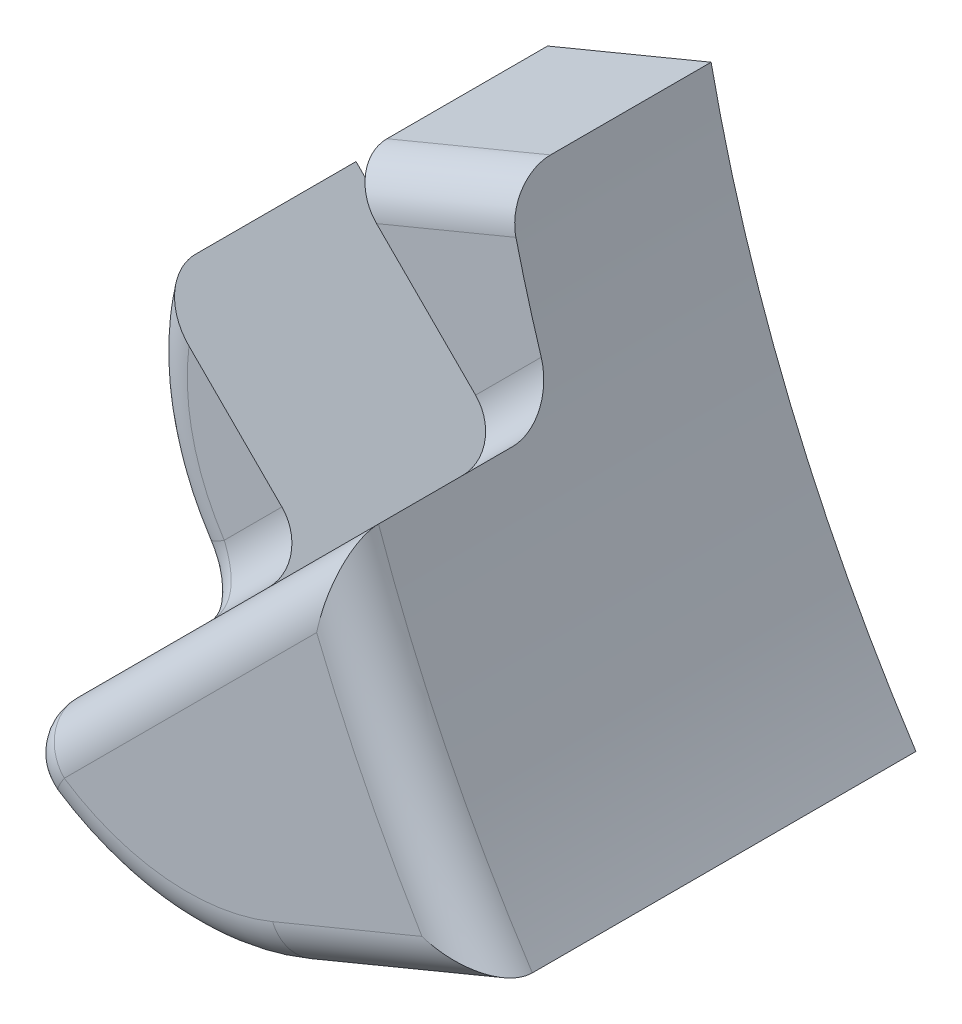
ISO-10303-21;
HEADER;
FILE_DESCRIPTION(('STEP AP214'),'2;1');
FILE_NAME('part.step','',(''),(''),'','','');
FILE_SCHEMA(('AUTOMOTIVE_DESIGN { 1 0 10303 214 1 1 1 1 }'));
ENDSEC;
DATA;
#1=APPLICATION_CONTEXT('core data for automotive mechanical design processes');
#2=APPLICATION_PROTOCOL_DEFINITION('international standard','automotive_design',2000,#1);
#3=PRODUCT_CONTEXT('',#1,'mechanical');
#4=PRODUCT('Part','Part','',(#3));
#5=PRODUCT_RELATED_PRODUCT_CATEGORY('part','',(#4));
#6=PRODUCT_DEFINITION_FORMATION('','',#4);
#7=PRODUCT_DEFINITION_CONTEXT('part definition',#1,'design');
#8=PRODUCT_DEFINITION('design','',#6,#7);
#9=PRODUCT_DEFINITION_SHAPE('','',#8);
#10=(LENGTH_UNIT() NAMED_UNIT(*) SI_UNIT(.MILLI.,.METRE.));
#11=(NAMED_UNIT(*) PLANE_ANGLE_UNIT() SI_UNIT($,.RADIAN.));
#12=(NAMED_UNIT(*) SI_UNIT($,.STERADIAN.) SOLID_ANGLE_UNIT());
#13=UNCERTAINTY_MEASURE_WITH_UNIT(LENGTH_MEASURE(1.E-05),#10,'distance_accuracy_value','');
#14=(GEOMETRIC_REPRESENTATION_CONTEXT(3) GLOBAL_UNCERTAINTY_ASSIGNED_CONTEXT((#13)) GLOBAL_UNIT_ASSIGNED_CONTEXT((#10,
#11,#12)) REPRESENTATION_CONTEXT('',''));
#15=CARTESIAN_POINT('',(0.,0.,0.));
#16=DIRECTION('',(0.,0.,1.));
#17=DIRECTION('',(1.,0.,0.));
#18=AXIS2_PLACEMENT_3D('',#15,#16,#17);
#19=CARTESIAN_POINT('',(-115.142337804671,-27.0739465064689,30.48));
#20=DIRECTION('',(0.382683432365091,-0.923879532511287,0.));
#21=DIRECTION('',(0.923879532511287,0.382683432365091,0.));
#22=AXIS2_PLACEMENT_3D('',#19,#20,#21);
#23=PLANE('',#22);
#24=DIRECTION('',(0.,0.,-1.));
#25=VECTOR('',#24,1.);
#26=CARTESIAN_POINT('',(-112.682457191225,-26.0550305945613,30.48));
#27=LINE('',#26,#25);
#28=CARTESIAN_POINT('',(-112.682457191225,-26.0550305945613,11.43));
#29=VERTEX_POINT('',#28);
#30=CARTESIAN_POINT('',(-112.682457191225,-26.0550305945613,0.));
#31=VERTEX_POINT('',#30);
#32=EDGE_CURVE('E710',#29,#31,#27,.T.);
#33=ORIENTED_EDGE('',*,*,#32,.F.);
#34=DIRECTION('',(-0.923879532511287,-0.382683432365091,0.));
#35=VECTOR('',#34,1.);
#36=CARTESIAN_POINT('',(-101.043939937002,-21.2341989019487,11.43));
#37=LINE('',#36,#35);
#38=CARTESIAN_POINT('',(-101.043939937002,-21.2341989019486,11.43));
#39=VERTEX_POINT('',#38);
#40=EDGE_CURVE('E67',#29,#39,#37,.F.);
#41=ORIENTED_EDGE('',*,*,#40,.T.);
#42=DIRECTION('',(0.,0.,-1.));
#43=VECTOR('',#42,1.);
#44=CARTESIAN_POINT('',(-101.043939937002,-21.2341989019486,30.48));
#45=LINE('',#44,#43);
#46=CARTESIAN_POINT('',(-101.043939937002,-21.2341989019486,0.));
#47=VERTEX_POINT('',#46);
#48=EDGE_CURVE('E285',#39,#47,#45,.T.);
#49=ORIENTED_EDGE('',*,*,#48,.T.);
#50=DIRECTION('',(-0.923879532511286,-0.382683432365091,0.));
#51=VECTOR('',#50,1.);
#52=CARTESIAN_POINT('',(-115.142337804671,-27.0739465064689,0.));
#53=LINE('',#52,#51);
#54=EDGE_CURVE('E282',#47,#31,#53,.T.);
#55=ORIENTED_EDGE('',*,*,#54,.T.);
#56=EDGE_LOOP('',(#33,#41,#49,#55));
#57=FACE_BOUND('',#56,.T.);
#58=ADVANCED_FACE('F35',(#57),#23,.F.);
#59=CARTESIAN_POINT('',(-107.852218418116,-44.6738516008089,30.48));
#60=DIRECTION('',(0.,0.,-1.));
#61=DIRECTION('',(-1.,0.,0.));
#62=AXIS2_PLACEMENT_3D('',#59,#60,#61);
#63=CYLINDRICAL_SURFACE('',#62,19.05);
#64=CARTESIAN_POINT('',(-119.020195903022,-55.5971603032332,18.8137614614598));
#65=CARTESIAN_POINT('',(-121.625966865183,-58.3049461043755,18.6042838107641));
#66=CARTESIAN_POINT('',(-118.706515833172,-60.3290976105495,19.8475229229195));
#67=CARTESIAN_POINT('',(-118.992671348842,-55.6100280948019,18.7308483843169));
#68=CARTESIAN_POINT('',(-121.619558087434,-58.325243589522,18.5303714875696));
#69=CARTESIAN_POINT('',(-118.649250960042,-60.3687743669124,19.6816967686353));
#70=CARTESIAN_POINT('',(-118.96825981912,-55.6211401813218,18.6467175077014));
#71=CARTESIAN_POINT('',(-121.614895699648,-58.342619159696,18.4583713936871));
#72=CARTESIAN_POINT('',(-118.598642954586,-60.4034230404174,19.5134350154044));
#73=CARTESIAN_POINT('',(-118.926042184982,-55.6400219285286,18.4766118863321));
#74=CARTESIAN_POINT('',(-121.607971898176,-58.3720715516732,18.3169957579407));
#75=CARTESIAN_POINT('',(-118.511322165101,-60.4627407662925,19.1732237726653));
#76=CARTESIAN_POINT('',(-118.908236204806,-55.6477915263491,18.3906371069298));
#77=CARTESIAN_POINT('',(-121.605726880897,-58.3841023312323,18.2477312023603));
#78=CARTESIAN_POINT('',(-118.474609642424,-60.4874096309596,19.0012742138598));
#79=CARTESIAN_POINT('',(-118.87962512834,-55.6601503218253,18.2175294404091));
#80=CARTESIAN_POINT('',(-121.602584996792,-58.4032190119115,18.1113884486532));
#81=CARTESIAN_POINT('',(-118.415694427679,-60.5268221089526,18.655058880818));
#82=CARTESIAN_POINT('',(-118.868812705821,-55.6647428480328,18.1303978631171));
#83=CARTESIAN_POINT('',(-121.601693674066,-58.410278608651,18.0444224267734));
#84=CARTESIAN_POINT('',(-118.393476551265,-60.541576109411,18.4807957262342));
#85=CARTESIAN_POINT('',(-118.854370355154,-55.6708547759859,17.9555119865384));
#86=CARTESIAN_POINT('',(-121.600586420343,-58.4196793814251,17.9115823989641));
#87=CARTESIAN_POINT('',(-118.363813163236,-60.5612429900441,18.1310239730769));
#88=CARTESIAN_POINT('',(-118.850740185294,-55.6723742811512,17.8677577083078));
#89=CARTESIAN_POINT('',(-121.600372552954,-58.422004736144,17.8458222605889));
#90=CARTESIAN_POINT('',(-118.356367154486,-60.5661562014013,17.9555154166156));
#91=CARTESIAN_POINT('',(-118.85074191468,-55.6723741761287,17.6914656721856));
#92=CARTESIAN_POINT('',(-121.600370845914,-58.4220050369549,17.7135952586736));
#93=CARTESIAN_POINT('',(-118.356370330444,-60.5661549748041,17.6029313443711));
#94=CARTESIAN_POINT('',(-118.854438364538,-55.6708275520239,17.6029278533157));
#95=CARTESIAN_POINT('',(-121.600586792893,-58.4196386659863,17.6472434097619));
#96=CARTESIAN_POINT('',(-118.363951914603,-60.5611531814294,17.4258557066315));
#97=CARTESIAN_POINT('',(-118.869132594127,-55.6646059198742,17.4264861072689));
#98=CARTESIAN_POINT('',(-121.601722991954,-58.4100671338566,17.5132023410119));
#99=CARTESIAN_POINT('',(-118.394134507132,-60.5411377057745,17.0729722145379));
#100=CARTESIAN_POINT('',(-118.880133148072,-55.6599297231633,17.3385824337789));
#101=CARTESIAN_POINT('',(-121.602641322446,-58.4028766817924,17.4456293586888));
#102=CARTESIAN_POINT('',(-118.416741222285,-60.5261202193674,16.8971648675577));
#103=CARTESIAN_POINT('',(-118.923800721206,-55.6410701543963,17.0768806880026));
#104=CARTESIAN_POINT('',(-121.607427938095,-58.3737585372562,17.2396217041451));
#105=CARTESIAN_POINT('',(-118.506658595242,-60.4659724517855,16.3737613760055));
#106=CARTESIAN_POINT('',(-118.967134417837,-55.622056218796,16.904868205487));
#107=CARTESIAN_POINT('',(-121.613295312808,-58.3443938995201,17.0977584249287));
#108=CARTESIAN_POINT('',(-118.596067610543,-60.4057471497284,16.029736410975));
#109=CARTESIAN_POINT('',(-119.078783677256,-55.5696746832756,16.571018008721));
#110=CARTESIAN_POINT('',(-121.639775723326,-58.2619260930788,16.8007422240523));
#111=CARTESIAN_POINT('',(-118.828465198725,-60.244470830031,15.3620360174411));
#112=CARTESIAN_POINT('',(-119.147079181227,-55.5363186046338,16.4091722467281));
#113=CARTESIAN_POINT('',(-121.660137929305,-58.2093197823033,16.6464534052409));
#114=CARTESIAN_POINT('',(-118.971410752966,-60.1434525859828,15.0383444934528));
#115=CARTESIAN_POINT('',(-119.303576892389,-55.4529830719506,16.0996503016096));
#116=CARTESIAN_POINT('',(-121.725132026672,-58.0764328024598,16.3298249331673));
#117=CARTESIAN_POINT('',(-119.303107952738,-59.8995500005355,14.4193006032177));
#118=CARTESIAN_POINT('',(-119.391785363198,-55.4029983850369,15.9519785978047));
#119=CARTESIAN_POINT('',(-121.769326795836,-57.9967191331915,16.1679744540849));
#120=CARTESIAN_POINT('',(-119.491874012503,-59.7566524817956,14.1239571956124));
#121=CARTESIAN_POINT('',(-119.583137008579,-55.2830867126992,15.6730146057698));
#122=CARTESIAN_POINT('',(-121.887855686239,-57.8056601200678,15.8460908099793));
#123=CARTESIAN_POINT('',(-119.908253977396,-59.426000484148,13.5660292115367));
#124=CARTESIAN_POINT('',(-119.686457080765,-55.2129123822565,15.5419564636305));
#125=CARTESIAN_POINT('',(-121.962102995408,-57.6943945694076,15.685996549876));
#126=CARTESIAN_POINT('',(-120.136334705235,-59.2376946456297,13.3039129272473));
#127=CARTESIAN_POINT('',(-119.900054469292,-55.0504621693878,15.3021886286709));
#128=CARTESIAN_POINT('',(-122.140096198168,-57.4400127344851,15.3849109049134));
#129=CARTESIAN_POINT('',(-120.618280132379,-58.8171258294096,12.8243772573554));
#130=CARTESIAN_POINT('',(-120.010331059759,-54.9581885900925,15.1934766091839));
#131=CARTESIAN_POINT('',(-122.243628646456,-57.2970507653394,15.2432715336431));
#132=CARTESIAN_POINT('',(-120.872142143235,-58.5848674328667,12.6069532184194));
#133=CARTESIAN_POINT('',(-120.228811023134,-54.7515999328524,15.0031453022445));
#134=CARTESIAN_POINT('',(-122.4725521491,-56.9840178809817,14.9956137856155));
#135=CARTESIAN_POINT('',(-121.389359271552,-58.081919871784,12.2262906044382));
#136=CARTESIAN_POINT('',(-120.337020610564,-54.6376376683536,14.9211427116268));
#137=CARTESIAN_POINT('',(-122.597824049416,-56.814039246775,14.8882184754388));
#138=CARTESIAN_POINT('',(-121.652513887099,-57.8118620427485,12.062285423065));
#139=CARTESIAN_POINT('',(-120.546176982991,-54.3869690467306,14.7845536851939));
#140=CARTESIAN_POINT('',(-122.862292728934,-56.4511462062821,14.7175144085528));
#141=CARTESIAN_POINT('',(-122.179396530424,-57.235164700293,11.7891073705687));
#142=CARTESIAN_POINT('',(-120.647129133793,-54.2502797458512,14.7299468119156));
#143=CARTESIAN_POINT('',(-123.002178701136,-56.2573100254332,14.6534293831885));
#144=CARTESIAN_POINT('',(-122.443123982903,-56.9285526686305,11.6798936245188));
#145=CARTESIAN_POINT('',(-120.831940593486,-53.9626033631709,14.6511825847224));
#146=CARTESIAN_POINT('',(-123.279777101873,-55.8641214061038,14.5778468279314));
#147=CARTESIAN_POINT('',(-122.948390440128,-56.2998483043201,11.5223651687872));
#148=CARTESIAN_POINT('',(-120.916350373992,-53.8124904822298,14.625810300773));
#149=CARTESIAN_POINT('',(-123.41820238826,-55.6641169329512,14.5639915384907));
#150=CARTESIAN_POINT('',(-123.1903957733,-55.9789992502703,11.4716205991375));
#151=CARTESIAN_POINT('',(-121.069778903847,-53.4964940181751,14.6013544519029));
#152=CARTESIAN_POINT('',(-123.690930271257,-55.260429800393,14.584844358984));
#153=CARTESIAN_POINT('',(-123.656165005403,-55.3181484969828,11.4227089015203));
#154=CARTESIAN_POINT('',(-121.138780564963,-53.330593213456,14.6022999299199));
#155=CARTESIAN_POINT('',(-123.826106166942,-55.0553715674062,14.6200336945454));
#156=CARTESIAN_POINT('',(-123.879908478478,-54.9781260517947,11.4245998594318));
#157=CARTESIAN_POINT('',(-121.22933848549,-53.0733681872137,14.6226828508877));
#158=CARTESIAN_POINT('',(-124.020535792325,-54.7542200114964,14.7074685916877));
#159=CARTESIAN_POINT('',(-124.197247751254,-54.4607862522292,11.4653657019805));
#160=CARTESIAN_POINT('',(-121.257420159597,-52.9860050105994,14.632686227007));
#161=CARTESIAN_POINT('',(-124.084575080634,-54.6539183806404,14.7428595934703));
#162=CARTESIAN_POINT('',(-124.300212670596,-54.286683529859,11.4853724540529));
#163=CARTESIAN_POINT('',(-121.309180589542,-52.8091347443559,14.6588493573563));
#164=CARTESIAN_POINT('',(-124.209631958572,-54.4564184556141,14.8248996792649));
#165=CARTESIAN_POINT('',(-124.499503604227,-53.9372607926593,11.5376987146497));
#166=CARTESIAN_POINT('',(-121.332858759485,-52.7196273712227,14.6750099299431));
#167=CARTESIAN_POINT('',(-124.270721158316,-54.3590921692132,14.8717139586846));
#168=CARTESIAN_POINT('',(-124.595828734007,-53.7619406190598,11.5700198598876));
#169=CARTESIAN_POINT('',(-121.375779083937,-52.5393252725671,14.7132189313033));
#170=CARTESIAN_POINT('',(-124.3892898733,-54.1692246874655,14.9758281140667));
#171=CARTESIAN_POINT('',(-124.781266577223,-53.4116446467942,11.6464378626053));
#172=CARTESIAN_POINT('',(-121.395029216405,-52.4485331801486,14.7352566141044));
#173=CARTESIAN_POINT('',(-124.446829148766,-54.0765792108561,15.0332982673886));
#174=CARTESIAN_POINT('',(-124.870392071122,-53.2366688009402,11.6905132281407));
#175=CARTESIAN_POINT('',(-121.429281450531,-52.2661941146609,14.7849700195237));
#176=CARTESIAN_POINT('',(-124.558167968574,-53.8973039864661,15.1578476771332));
#177=CARTESIAN_POINT('',(-125.041449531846,-52.88790714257,11.7899400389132));
#178=CARTESIAN_POINT('',(-121.444285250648,-52.1746474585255,14.8126434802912));
#179=CARTESIAN_POINT('',(-124.612002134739,-53.8106184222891,15.2251272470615));
#180=CARTESIAN_POINT('',(-125.123384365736,-52.7141208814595,11.8452869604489));
#181=CARTESIAN_POINT('',(-121.457240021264,-52.0830322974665,14.8430122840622));
#182=CARTESIAN_POINT('',(-124.663460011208,-53.7282953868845,15.2962903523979));
#183=CARTESIAN_POINT('',(-125.201672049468,-52.5414407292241,11.9060245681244));
#184=(BOUNDED_SURFACE() B_SPLINE_SURFACE(3,2,((#64,#65,#66),(#67,#68,#69),(#70,#71,#72),(#73,
#74,#75),(#76,#77,#78),(#79,#80,#81),(#82,#83,#84),(#85,#86,#87),(#88,#89,#90),(#91,#92,#93),
(#94,#95,#96),(#97,#98,#99),(#100,#101,#102),(#103,#104,#105),(#106,#107,#108),(#109,#110,#111),
(#112,#113,#114),(#115,#116,#117),(#118,#119,#120),(#121,#122,#123),(#124,#125,#126),(#127,#128,
#129),(#130,#131,#132),(#133,#134,#135),(#136,#137,#138),(#139,#140,#141),(#142,#143,#144),
(#145,#146,#147),(#148,#149,#150),(#151,#152,#153),(#154,#155,#156),(#157,#158,#159),(#160,#161,
#162),(#163,#164,#165),(#166,#167,#168),(#169,#170,#171),(#172,#173,#174),(#175,#176,#177),
(#178,#179,#180),(#181,#182,#183)),.UNSPECIFIED.,.F.,.F.,.F.) B_SPLINE_SURFACE_WITH_KNOTS((4,2,
2,2,2,2,2,2,2,2,2,2,2,2,2,2,2,2,2,4),(3,3),(0.,0.526938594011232,1.05388709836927,
1.58028269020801,2.10666056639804,2.63769666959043,3.16893458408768,4.23008557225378,
5.29038570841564,6.35101982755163,7.42524558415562,8.49935943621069,9.55729970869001,
10.6144495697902,11.6258721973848,12.6384110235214,13.1471960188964,13.6560486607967,
14.1639771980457,14.6717022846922),(0.,1.),
.UNSPECIFIED.) GEOMETRIC_REPRESENTATION_ITEM() RATIONAL_B_SPLINE_SURFACE(((1.,0.644789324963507,
1.),(1.,0.642846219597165,1.),(1.,0.641095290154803,1.),(1.,0.638036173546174,1.),(1.,
0.63672799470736,1.),(1.,0.634613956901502,1.),(1.,0.633807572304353,1.),(1.,0.632728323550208,
1.),(1.,0.632455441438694,1.),(1.,0.63245562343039,1.),(1.,0.63273354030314,1.),(1.,
0.633831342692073,1.),(1.,0.634651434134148,1.),(1.,0.637878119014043,1.),(1.,0.641051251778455,
1.),(1.,0.648917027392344,1.),(1.,0.653608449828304,1.),(1.,0.663776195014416,1.),(1.,
0.669252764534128,1.),(1.,0.680246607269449,1.),(1.,0.685763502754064,1.),(1.,0.695937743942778,
1.),(1.,0.700595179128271,1.),(1.,0.708254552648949,1.),(1.,0.711280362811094,1.),(1.,
0.715222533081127,1.),(1.,0.716140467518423,1.),(1.,0.715536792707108,1.),(1.,0.714118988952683,
1.),(1.,0.708931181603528,1.),(1.,0.705158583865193,1.),(1.,0.697801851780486,1.),(1.,
0.695057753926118,1.),(1.,0.689027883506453,1.),(1.,0.685742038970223,1.),(1.,0.678669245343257,
1.),(1.,0.674883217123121,1.),(1.,0.666848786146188,1.),(1.,0.662600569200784,1.),(1.,
0.658141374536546,1.))) REPRESENTATION_ITEM('') SURFACE());
#185=CARTESIAN_POINT('',(-125.201672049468,-52.5414407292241,11.9060245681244));
#186=CARTESIAN_POINT('',(-125.123384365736,-52.7141208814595,11.8452869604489));
#187=CARTESIAN_POINT('',(-125.041449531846,-52.88790714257,11.7899400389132));
#188=CARTESIAN_POINT('',(-124.870392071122,-53.2366688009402,11.6905132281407));
#189=CARTESIAN_POINT('',(-124.781266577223,-53.4116446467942,11.6464378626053));
#190=CARTESIAN_POINT('',(-124.595828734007,-53.7619406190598,11.5700198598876));
#191=CARTESIAN_POINT('',(-124.499503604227,-53.9372607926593,11.5376987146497));
#192=CARTESIAN_POINT('',(-124.300212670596,-54.286683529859,11.4853724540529));
#193=CARTESIAN_POINT('',(-124.197247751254,-54.4607862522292,11.4653657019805));
#194=CARTESIAN_POINT('',(-123.879908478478,-54.9781260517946,11.4245998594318));
#195=CARTESIAN_POINT('',(-123.656165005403,-55.3181484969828,11.4227089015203));
#196=CARTESIAN_POINT('',(-123.1903957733,-55.9789992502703,11.4716205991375));
#197=CARTESIAN_POINT('',(-122.948390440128,-56.2998483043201,11.5223651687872));
#198=CARTESIAN_POINT('',(-122.443123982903,-56.9285526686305,11.6798936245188));
#199=CARTESIAN_POINT('',(-122.179396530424,-57.235164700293,11.7891073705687));
#200=CARTESIAN_POINT('',(-121.652513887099,-57.8118620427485,12.062285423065));
#201=CARTESIAN_POINT('',(-121.389359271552,-58.081919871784,12.2262906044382));
#202=CARTESIAN_POINT('',(-120.872142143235,-58.5848674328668,12.6069532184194));
#203=CARTESIAN_POINT('',(-120.618280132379,-58.8171258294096,12.8243772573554));
#204=CARTESIAN_POINT('',(-120.136334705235,-59.2376946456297,13.3039129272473));
#205=CARTESIAN_POINT('',(-119.908253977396,-59.426000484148,13.5660292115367));
#206=CARTESIAN_POINT('',(-119.491874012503,-59.7566524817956,14.1239571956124));
#207=CARTESIAN_POINT('',(-119.303107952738,-59.8995500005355,14.4193006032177));
#208=CARTESIAN_POINT('',(-118.971410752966,-60.1434525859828,15.0383444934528));
#209=CARTESIAN_POINT('',(-118.828465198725,-60.244470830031,15.3620360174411));
#210=CARTESIAN_POINT('',(-118.596067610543,-60.4057471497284,16.029736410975));
#211=CARTESIAN_POINT('',(-118.506658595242,-60.4659724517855,16.3737613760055));
#212=CARTESIAN_POINT('',(-118.416741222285,-60.5261202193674,16.8971648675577));
#213=CARTESIAN_POINT('',(-118.394134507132,-60.5411377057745,17.0729722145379));
#214=CARTESIAN_POINT('',(-118.363951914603,-60.5611531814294,17.4258557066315));
#215=CARTESIAN_POINT('',(-118.356370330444,-60.5661549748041,17.6029313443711));
#216=CARTESIAN_POINT('',(-118.356367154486,-60.5661562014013,17.9555154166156));
#217=CARTESIAN_POINT('',(-118.363813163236,-60.5612429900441,18.1310239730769));
#218=CARTESIAN_POINT('',(-118.393476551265,-60.541576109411,18.4807957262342));
#219=CARTESIAN_POINT('',(-118.415694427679,-60.5268221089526,18.655058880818));
#220=CARTESIAN_POINT('',(-118.474609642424,-60.4874096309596,19.0012742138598));
#221=CARTESIAN_POINT('',(-118.511322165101,-60.4627407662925,19.1732237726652));
#222=CARTESIAN_POINT('',(-118.598642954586,-60.4034230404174,19.5134350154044));
#223=CARTESIAN_POINT('',(-118.649250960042,-60.3687743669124,19.6816967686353));
#224=CARTESIAN_POINT('',(-118.706515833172,-60.3290976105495,19.8475229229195));
#225=B_SPLINE_CURVE_WITH_KNOTS('',3,(#185,#186,#187,#188,#189,#190,#191,#192,#193,#194,#195,
#196,#197,#198,#199,#200,#201,#202,#203,#204,#205,#206,#207,#208,#209,#210,#211,#212,#213,#214,
#215,#216,#217,#218,#219,#220,#221,#222,#223,#224),.UNSPECIFIED.,.F.,.F.,(4,2,2,2,2,2,2,2,2,2,2,
2,2,2,2,2,2,2,2,4),(0.,0.507725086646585,1.0156536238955,1.52450626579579,2.0332912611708,
3.04583008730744,4.05725271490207,5.11440257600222,6.17234284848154,7.24645670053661,
8.32068245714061,9.3813165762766,10.4416167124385,11.5027677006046,12.0340056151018,
12.5650417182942,13.0914195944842,13.617815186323,14.144763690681,14.6717022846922),.UNSPECIFIED.);
#226=CARTESIAN_POINT('',(-123.744522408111,-55.178001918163,11.43));
#227=VERTEX_POINT('',#226);
#228=CARTESIAN_POINT('',(-118.35636873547,-60.5661555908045,17.78));
#229=VERTEX_POINT('',#228);
#230=EDGE_CURVE('E730',#227,#229,#225,.T.);
#231=ORIENTED_EDGE('',*,*,#230,.F.);
#232=CARTESIAN_POINT('',(-107.852218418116,-44.6738516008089,11.43));
#233=DIRECTION('',(0.,0.,1.));
#234=DIRECTION('',(1.,0.,0.));
#235=AXIS2_PLACEMENT_3D('',#232,#233,#234);
#236=CIRCLE('',#235,19.05);
#237=CARTESIAN_POINT('',(-126.318890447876,-39.9957618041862,11.43));
#238=VERTEX_POINT('',#237);
#239=EDGE_CURVE('E729',#227,#238,#236,.F.);
#240=ORIENTED_EDGE('',*,*,#239,.T.);
#241=DIRECTION('',(0.,0.,-1.));
#242=VECTOR('',#241,1.);
#243=CARTESIAN_POINT('',(-126.318890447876,-39.9957618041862,30.48));
#244=LINE('',#243,#242);
#245=CARTESIAN_POINT('',(-126.318890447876,-39.9957618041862,0.));
#246=VERTEX_POINT('',#245);
#247=EDGE_CURVE('E706',#246,#238,#244,.F.);
#248=ORIENTED_EDGE('',*,*,#247,.F.);
#249=CARTESIAN_POINT('',(-107.852218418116,-44.6738516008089,0.));
#250=DIRECTION('',(0.,0.,1.));
#251=DIRECTION('',(1.,0.,0.));
#252=AXIS2_PLACEMENT_3D('',#249,#250,#251);
#253=CIRCLE('',#252,19.05);
#254=CARTESIAN_POINT('',(-100.562099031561,-62.2737566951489,0.));
#255=VERTEX_POINT('',#254);
#256=EDGE_CURVE('E253',#246,#255,#253,.T.);
#257=ORIENTED_EDGE('',*,*,#256,.T.);
#258=DIRECTION('',(0.,0.,-1.));
#259=VECTOR('',#258,1.);
#260=CARTESIAN_POINT('',(-100.562099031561,-62.2737566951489,30.48));
#261=LINE('',#260,#259);
#262=CARTESIAN_POINT('',(-100.562099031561,-62.2737566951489,27.305));
#263=VERTEX_POINT('',#262);
#264=EDGE_CURVE('E289',#263,#255,#261,.T.);
#265=ORIENTED_EDGE('',*,*,#264,.F.);
#266=CARTESIAN_POINT('',(-107.852218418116,-44.6738516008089,27.305));
#267=DIRECTION('',(0.,0.,1.));
#268=DIRECTION('',(1.,0.,0.));
#269=AXIS2_PLACEMENT_3D('',#266,#267,#268);
#270=CIRCLE('',#269,19.05);
#271=CARTESIAN_POINT('',(-118.35636873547,-60.5661555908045,27.305));
#272=VERTEX_POINT('',#271);
#273=EDGE_CURVE('E733',#263,#272,#270,.F.);
#274=ORIENTED_EDGE('',*,*,#273,.T.);
#275=DIRECTION('',(0.,0.,-1.));
#276=VECTOR('',#275,1.);
#277=CARTESIAN_POINT('',(-118.35636873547,-60.5661555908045,30.48));
#278=LINE('',#277,#276);
#279=EDGE_CURVE('E737',#272,#229,#278,.T.);
#280=ORIENTED_EDGE('',*,*,#279,.T.);
#281=EDGE_LOOP('',(#231,#240,#248,#257,#265,#274,#280));
#282=FACE_BOUND('',#281,.T.);
#283=ADVANCED_FACE('F323',(#282),#63,.T.);
#284=CARTESIAN_POINT('',(0.,0.,14.605));
#285=DIRECTION('',(0.,0.,1.));
#286=DIRECTION('',(1.,0.,0.));
#287=AXIS2_PLACEMENT_3D('',#284,#285,#286);
#288=PLANE('',#287);
#289=DIRECTION('',(-0.707106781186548,0.707106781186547,0.));
#290=VECTOR('',#289,1.);
#291=CARTESIAN_POINT('',(-83.157326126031,-83.1573261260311,14.605));
#292=LINE('',#291,#290);
#293=CARTESIAN_POINT('',(-116.991573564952,-49.3230786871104,14.605));
#294=VERTEX_POINT('',#293);
#295=CARTESIAN_POINT('',(-123.605209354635,-42.7094428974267,14.605));
#296=VERTEX_POINT('',#295);
#297=EDGE_CURVE('E707',#294,#296,#292,.T.);
#298=ORIENTED_EDGE('',*,*,#297,.T.);
#299=CARTESIAN_POINT('',(-107.852218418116,-44.6738516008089,14.605));
#300=DIRECTION('',(0.,0.,1.));
#301=DIRECTION('',(1.,0.,0.));
#302=AXIS2_PLACEMENT_3D('',#299,#300,#301);
#303=CIRCLE('',#302,15.875);
#304=CARTESIAN_POINT('',(-121.095805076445,-53.427310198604,14.605));
#305=VERTEX_POINT('',#304);
#306=EDGE_CURVE('E781',#296,#305,#303,.T.);
#307=ORIENTED_EDGE('',*,*,#306,.T.);
#308=DIRECTION('',(0.707106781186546,0.707106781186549,0.));
#309=VECTOR('',#308,1.);
#310=CARTESIAN_POINT('',(-33.8342474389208,33.8342474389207,14.605));
#311=LINE('',#310,#309);
#312=EDGE_CURVE('E352',#305,#294,#311,.T.);
#313=ORIENTED_EDGE('',*,*,#312,.T.);
#314=EDGE_LOOP('',(#298,#307,#313));
#315=FACE_BOUND('',#314,.T.);
#316=ADVANCED_FACE('F471',(#315),#288,.T.);
#317=DIRECTION('',(0.707106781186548,-0.707106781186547,0.));
#318=VECTOR('',#317,1.);
#319=CARTESIAN_POINT('',(-69.3687438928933,-69.3687438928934,14.605));
#320=LINE('',#319,#318);
#321=CARTESIAN_POINT('',(-110.252417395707,-28.4850703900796,14.605));
#322=VERTEX_POINT('',#321);
#323=CARTESIAN_POINT('',(-103.202991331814,-35.5344964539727,14.605));
#324=VERTEX_POINT('',#323);
#325=EDGE_CURVE('E714',#322,#324,#320,.T.);
#326=ORIENTED_EDGE('',*,*,#325,.T.);
#327=DIRECTION('',(0.707106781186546,0.707106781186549,0.));
#328=VECTOR('',#327,1.);
#329=CARTESIAN_POINT('',(-33.8342474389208,33.8342474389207,14.605));
#330=LINE('',#329,#328);
#331=CARTESIAN_POINT('',(-98.530678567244,-30.8621836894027,14.605));
#332=VERTEX_POINT('',#331);
#333=EDGE_CURVE('E764',#324,#332,#330,.T.);
#334=ORIENTED_EDGE('',*,*,#333,.T.);
#335=CARTESIAN_POINT('',(0.,0.,14.605));
#336=DIRECTION('',(0.,0.,1.));
#337=DIRECTION('',(1.,0.,0.));
#338=AXIS2_PLACEMENT_3D('',#335,#336,#337);
#339=CIRCLE('',#338,103.251);
#340=CARTESIAN_POINT('',(-100.332336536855,-24.3760383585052,14.605));
#341=VERTEX_POINT('',#340);
#342=EDGE_CURVE('E272',#332,#341,#339,.F.);
#343=ORIENTED_EDGE('',*,*,#342,.T.);
#344=DIRECTION('',(-0.923879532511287,-0.382683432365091,0.));
#345=VECTOR('',#344,1.);
#346=CARTESIAN_POINT('',(-111.467437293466,-28.9883481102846,14.605));
#347=LINE('',#346,#345);
#348=EDGE_CURVE('E761',#341,#322,#347,.T.);
#349=ORIENTED_EDGE('',*,*,#348,.T.);
#350=EDGE_LOOP('',(#326,#334,#343,#349));
#351=FACE_BOUND('',#350,.T.);
#352=ADVANCED_FACE('F484',(#351),#288,.T.);
#353=CARTESIAN_POINT('',(-49.059725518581,14.1186412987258,14.605));
#354=DIRECTION('',(0.707106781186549,-0.707106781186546,0.));
#355=DIRECTION('',(0.707106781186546,0.707106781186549,0.));
#356=AXIS2_PLACEMENT_3D('',#353,#354,#355);
#357=PLANE('',#356);
#358=DIRECTION('',(0.,0.,-1.));
#359=VECTOR('',#358,1.);
#360=CARTESIAN_POINT('',(-97.4109730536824,-34.2326062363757,30.48));
#361=LINE('',#360,#359);
#362=CARTESIAN_POINT('',(-97.4109730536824,-34.2326062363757,17.78));
#363=VERTEX_POINT('',#362);
#364=CARTESIAN_POINT('',(-97.4109730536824,-34.2326062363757,27.305));
#365=VERTEX_POINT('',#364);
#366=EDGE_CURVE('E270',#363,#365,#361,.F.);
#367=ORIENTED_EDGE('',*,*,#366,.F.);
#368=DIRECTION('',(0.707106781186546,0.707106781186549,0.));
#369=VECTOR('',#368,1.);
#370=CARTESIAN_POINT('',(-49.059725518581,14.1186412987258,17.78));
#371=LINE('',#370,#369);
#372=CARTESIAN_POINT('',(-100.957927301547,-37.77956048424,17.78));
#373=VERTEX_POINT('',#372);
#374=EDGE_CURVE('E759',#363,#373,#371,.F.);
#375=ORIENTED_EDGE('',*,*,#374,.T.);
#376=DIRECTION('',(0.,0.,-1.));
#377=VECTOR('',#376,1.);
#378=CARTESIAN_POINT('',(-100.957927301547,-37.77956048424,14.605));
#379=LINE('',#378,#377);
#380=CARTESIAN_POINT('',(-100.957927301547,-37.77956048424,23.33));
#381=VERTEX_POINT('',#380);
#382=EDGE_CURVE('E294',#381,#373,#379,.T.);
#383=ORIENTED_EDGE('',*,*,#382,.F.);
#384=CARTESIAN_POINT('',(-101.523612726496,-38.3452459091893,23.33));
#385=DIRECTION('',(0.707106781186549,-0.707106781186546,0.));
#386=DIRECTION('',(0.707106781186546,0.707106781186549,0.));
#387=AXIS2_PLACEMENT_3D('',#384,#385,#386);
#388=CIRCLE('',#387,0.8);
#389=CARTESIAN_POINT('',(-101.523612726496,-38.3452459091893,24.13));
#390=VERTEX_POINT('',#389);
#391=EDGE_CURVE('E508',#381,#390,#388,.T.);
#392=ORIENTED_EDGE('',*,*,#391,.T.);
#393=DIRECTION('',(-0.707106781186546,-0.707106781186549,0.));
#394=VECTOR('',#393,1.);
#395=CARTESIAN_POINT('',(-49.059725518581,14.1186412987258,24.13));
#396=LINE('',#395,#394);
#397=CARTESIAN_POINT('',(-114.180824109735,-51.0024572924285,24.13));
#398=VERTEX_POINT('',#397);
#399=EDGE_CURVE('E291',#390,#398,#396,.T.);
#400=ORIENTED_EDGE('',*,*,#399,.T.);
#401=CARTESIAN_POINT('',(-114.180824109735,-51.0024572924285,23.33));
#402=DIRECTION('',(0.707106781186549,-0.707106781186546,0.));
#403=DIRECTION('',(0.707106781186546,0.707106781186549,0.));
#404=AXIS2_PLACEMENT_3D('',#401,#402,#403);
#405=CIRCLE('',#404,0.8);
#406=CARTESIAN_POINT('',(-114.746509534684,-51.5681427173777,23.33));
#407=VERTEX_POINT('',#406);
#408=EDGE_CURVE('E679',#398,#407,#405,.T.);
#409=ORIENTED_EDGE('',*,*,#408,.T.);
#410=DIRECTION('',(0.,0.,1.));
#411=VECTOR('',#410,1.);
#412=CARTESIAN_POINT('',(-114.746509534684,-51.5681427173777,14.605));
#413=LINE('',#412,#411);
#414=CARTESIAN_POINT('',(-114.746509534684,-51.5681427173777,17.78));
#415=VERTEX_POINT('',#414);
#416=EDGE_CURVE('E297',#415,#407,#413,.T.);
#417=ORIENTED_EDGE('',*,*,#416,.F.);
#418=DIRECTION('',(0.707106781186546,0.707106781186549,0.));
#419=VECTOR('',#418,1.);
#420=CARTESIAN_POINT('',(-49.059725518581,14.1186412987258,17.78));
#421=LINE('',#420,#419);
#422=CARTESIAN_POINT('',(-118.850741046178,-55.6723742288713,17.78));
#423=VERTEX_POINT('',#422);
#424=EDGE_CURVE('E757',#415,#423,#421,.F.);
#425=ORIENTED_EDGE('',*,*,#424,.T.);
#426=DIRECTION('',(0.,0.,-1.));
#427=VECTOR('',#426,1.);
#428=CARTESIAN_POINT('',(-118.850741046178,-55.6723742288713,14.605));
#429=LINE('',#428,#427);
#430=CARTESIAN_POINT('',(-118.850741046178,-55.6723742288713,27.305));
#431=VERTEX_POINT('',#430);
#432=EDGE_CURVE('E755',#423,#431,#429,.F.);
#433=ORIENTED_EDGE('',*,*,#432,.T.);
#434=DIRECTION('',(0.707106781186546,0.707106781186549,0.));
#435=VECTOR('',#434,1.);
#436=CARTESIAN_POINT('',(-97.4109730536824,-34.2326062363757,27.305));
#437=LINE('',#436,#435);
#438=EDGE_CURVE('E753',#431,#365,#437,.T.);
#439=ORIENTED_EDGE('',*,*,#438,.T.);
#440=EDGE_LOOP('',(#367,#375,#383,#392,#400,#409,#417,#425,#433,#439));
#441=FACE_BOUND('',#440,.T.);
#442=ADVANCED_FACE('F480',(#441),#357,.F.);
#443=CARTESIAN_POINT('',(-100.562099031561,-62.2737566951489,30.48));
#444=DIRECTION('',(-0.382683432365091,0.923879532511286,0.));
#445=DIRECTION('',(-0.923879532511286,-0.382683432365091,0.));
#446=AXIS2_PLACEMENT_3D('',#443,#444,#445);
#447=PLANE('',#446);
#448=DIRECTION('',(0.,0.,-1.));
#449=VECTOR('',#448,1.);
#450=CARTESIAN_POINT('',(-86.4637011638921,-56.4340090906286,30.48));
#451=LINE('',#450,#449);
#452=CARTESIAN_POINT('',(-86.4637011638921,-56.4340090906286,27.305));
#453=VERTEX_POINT('',#452);
#454=CARTESIAN_POINT('',(-86.4637011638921,-56.4340090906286,0.));
#455=VERTEX_POINT('',#454);
#456=EDGE_CURVE('E287',#453,#455,#451,.T.);
#457=ORIENTED_EDGE('',*,*,#456,.F.);
#458=DIRECTION('',(0.923879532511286,0.382683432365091,0.));
#459=VECTOR('',#458,1.);
#460=CARTESIAN_POINT('',(-100.562099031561,-62.2737566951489,27.305));
#461=LINE('',#460,#459);
#462=EDGE_CURVE('E726',#453,#263,#461,.F.);
#463=ORIENTED_EDGE('',*,*,#462,.T.);
#464=ORIENTED_EDGE('',*,*,#264,.T.);
#465=DIRECTION('',(0.923879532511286,0.382683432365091,0.));
#466=VECTOR('',#465,1.);
#467=CARTESIAN_POINT('',(-100.562099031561,-62.2737566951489,0.));
#468=LINE('',#467,#466);
#469=EDGE_CURVE('E276',#255,#455,#468,.T.);
#470=ORIENTED_EDGE('',*,*,#469,.T.);
#471=EDGE_LOOP('',(#457,#463,#464,#470));
#472=FACE_BOUND('',#471,.T.);
#473=ADVANCED_FACE('F483',(#472),#447,.F.);
#474=CARTESIAN_POINT('',(0.,0.,30.48));
#475=DIRECTION('',(0.,0.,-1.));
#476=DIRECTION('',(-1.,0.,0.));
#477=AXIS2_PLACEMENT_3D('',#474,#475,#476);
#478=CYLINDRICAL_SURFACE('',#477,103.251);
#479=ORIENTED_EDGE('',*,*,#48,.F.);
#480=CARTESIAN_POINT('',(-101.043939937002,-21.2341989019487,11.43));
#481=CARTESIAN_POINT('',(-101.043941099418,-21.2341892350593,11.5182443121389));
#482=CARTESIAN_POINT('',(-101.043170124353,-21.2378619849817,11.6064839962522));
#483=CARTESIAN_POINT('',(-101.040093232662,-21.2524978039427,11.7823222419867));
#484=CARTESIAN_POINT('',(-101.03778745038,-21.2634602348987,11.8699208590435));
#485=CARTESIAN_POINT('',(-101.031654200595,-21.2925822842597,12.0437494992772));
#486=CARTESIAN_POINT('',(-101.02782868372,-21.3107326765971,12.1299811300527));
#487=CARTESIAN_POINT('',(-101.018678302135,-21.3540656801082,12.300552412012));
#488=CARTESIAN_POINT('',(-101.013353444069,-21.3792482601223,12.3848920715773));
#489=CARTESIAN_POINT('',(-100.995158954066,-21.4650959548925,12.634231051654));
#490=CARTESIAN_POINT('',(-100.980065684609,-21.5360788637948,12.7956559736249));
#491=CARTESIAN_POINT('',(-100.944269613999,-21.7032414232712,13.1040688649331));
#492=CARTESIAN_POINT('',(-100.923566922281,-21.7994205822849,13.2510571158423));
#493=CARTESIAN_POINT('',(-100.876764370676,-22.0149868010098,13.5279219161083));
#494=CARTESIAN_POINT('',(-100.850621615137,-22.1345578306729,13.6576481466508));
#495=CARTESIAN_POINT('',(-100.793576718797,-22.3928863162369,13.8951201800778));
#496=CARTESIAN_POINT('',(-100.762673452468,-22.5316483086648,14.0028607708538));
#497=CARTESIAN_POINT('',(-100.696246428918,-22.8266983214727,14.1950628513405));
#498=CARTESIAN_POINT('',(-100.66065734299,-22.9832287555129,14.2791293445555));
#499=CARTESIAN_POINT('',(-100.586066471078,-23.3075063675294,14.4194379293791));
#500=CARTESIAN_POINT('',(-100.547066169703,-23.4752486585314,14.4756920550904));
#501=CARTESIAN_POINT('',(-100.478703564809,-23.7658210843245,14.5464219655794));
#502=CARTESIAN_POINT('',(-100.449958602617,-23.8870332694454,14.5683676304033));
#503=CARTESIAN_POINT('',(-100.391668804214,-24.1308457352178,14.597656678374));
#504=CARTESIAN_POINT('',(-100.362125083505,-24.2534439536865,14.605019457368));
#505=CARTESIAN_POINT('',(-100.332336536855,-24.3760383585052,14.605));
#506=B_SPLINE_CURVE_WITH_KNOTS('',3,(#480,#481,#482,#483,#484,#485,#486,#487,#488,#489,#490,
#491,#492,#493,#494,#495,#496,#497,#498,#499,#500,#501,#502,#503,#504,#505),.UNSPECIFIED.,.F.,
.F.,(4,2,2,2,2,2,2,2,2,2,2,2,4),(0.,0.264644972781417,0.529266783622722,0.793550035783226,
1.05783211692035,1.58607884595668,2.11431527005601,2.64688646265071,3.17958376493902,
3.72070348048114,4.26158885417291,4.64025918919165,5.0184255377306),.UNSPECIFIED.);
#507=EDGE_CURVE('E771',#39,#341,#506,.T.);
#508=ORIENTED_EDGE('',*,*,#507,.T.);
#509=ORIENTED_EDGE('',*,*,#342,.F.);
#510=CARTESIAN_POINT('',(-98.530678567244,-30.8621836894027,14.605));
#511=CARTESIAN_POINT('',(-98.4978832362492,-30.9668893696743,14.6050052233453));
#512=CARTESIAN_POINT('',(-98.4649314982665,-31.0715021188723,14.609467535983));
#513=CARTESIAN_POINT('',(-98.3989102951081,-31.279951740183,14.6273595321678));
#514=CARTESIAN_POINT('',(-98.3658407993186,-31.3837883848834,14.6407917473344));
#515=CARTESIAN_POINT('',(-98.2665898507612,-31.6937425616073,14.6947207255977));
#516=CARTESIAN_POINT('',(-98.2005536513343,-31.897705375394,14.7488505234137));
#517=CARTESIAN_POINT('',(-98.0709892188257,-32.2938631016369,14.8935126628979));
#518=CARTESIAN_POINT('',(-98.0074667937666,-32.4860312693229,14.9841244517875));
#519=CARTESIAN_POINT('',(-97.9162118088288,-32.7596368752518,15.1463522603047));
#520=CARTESIAN_POINT('',(-97.8864679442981,-32.8483887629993,15.2048054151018));
#521=CARTESIAN_POINT('',(-97.8286480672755,-33.0201877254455,15.3302589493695));
#522=CARTESIAN_POINT('',(-97.8005711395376,-33.1032379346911,15.3972545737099));
#523=CARTESIAN_POINT('',(-97.7484910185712,-33.2566922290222,15.5340865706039));
#524=CARTESIAN_POINT('',(-97.7243402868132,-33.3275776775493,15.6033279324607));
#525=CARTESIAN_POINT('',(-97.6780862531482,-33.4628984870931,15.748415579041));
#526=CARTESIAN_POINT('',(-97.655981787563,-33.5273375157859,15.824258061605));
#527=CARTESIAN_POINT('',(-97.6141040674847,-33.6490688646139,15.9821132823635));
#528=CARTESIAN_POINT('',(-97.5943313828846,-33.7063594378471,16.0641275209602));
#529=CARTESIAN_POINT('',(-97.5574215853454,-33.8130401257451,16.2336969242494));
#530=CARTESIAN_POINT('',(-97.540284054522,-33.8624314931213,16.3212512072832));
#531=CARTESIAN_POINT('',(-97.5106625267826,-33.9476287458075,16.4911722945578));
#532=CARTESIAN_POINT('',(-97.4978731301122,-33.9843340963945,16.5730360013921));
#533=CARTESIAN_POINT('',(-97.4747702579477,-34.0505417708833,16.7399586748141));
#534=CARTESIAN_POINT('',(-97.4644564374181,-34.0800450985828,16.8250171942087));
#535=CARTESIAN_POINT('',(-97.446469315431,-34.1314423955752,16.9974983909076));
#536=CARTESIAN_POINT('',(-97.4387910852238,-34.1533505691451,17.0849163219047));
#537=CARTESIAN_POINT('',(-97.426166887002,-34.1893458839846,17.2615009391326));
#538=CARTESIAN_POINT('',(-97.4212192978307,-34.2034376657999,17.3506665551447));
#539=CARTESIAN_POINT('',(-97.4154422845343,-34.2198867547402,17.4967129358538));
#540=CARTESIAN_POINT('',(-97.4137660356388,-34.2246578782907,17.5533003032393));
#541=CARTESIAN_POINT('',(-97.4115318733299,-34.2310160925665,17.6665892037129));
#542=CARTESIAN_POINT('',(-97.4109722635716,-34.2326080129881,17.7232904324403));
#543=CARTESIAN_POINT('',(-97.4109730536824,-34.2326062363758,17.78));
#544=B_SPLINE_CURVE_WITH_KNOTS('',3,(#510,#511,#512,#513,#514,#515,#516,#517,#518,#519,#520,
#521,#522,#523,#524,#525,#526,#527,#528,#529,#530,#531,#532,#533,#534,#535,#536,#537,#538,#539,
#540,#541,#542,#543),.UNSPECIFIED.,.F.,.F.,(4,2,2,2,2,2,2,2,2,2,2,2,2,2,2,2,4),(0.,
0.328986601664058,0.658066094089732,1.31808493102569,1.97954894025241,2.31020889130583,
2.64068557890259,2.94624592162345,3.25163141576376,3.55709139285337,3.86250287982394,
4.1340104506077,4.4054801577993,4.67643939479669,4.9472375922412,5.11758378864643,
5.28767100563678),.UNSPECIFIED.);
#545=EDGE_CURVE('E51',#332,#363,#544,.T.);
#546=ORIENTED_EDGE('',*,*,#545,.T.);
#547=ORIENTED_EDGE('',*,*,#366,.T.);
#548=CARTESIAN_POINT('',(0.,0.,27.305));
#549=DIRECTION('',(0.,0.,1.));
#550=DIRECTION('',(1.,0.,0.));
#551=AXIS2_PLACEMENT_3D('',#548,#549,#550);
#552=CIRCLE('',#551,103.251);
#553=EDGE_CURVE('E59',#365,#453,#552,.T.);
#554=ORIENTED_EDGE('',*,*,#553,.T.);
#555=ORIENTED_EDGE('',*,*,#456,.T.);
#556=CARTESIAN_POINT('',(0.,0.,0.));
#557=DIRECTION('',(0.,0.,-1.));
#558=DIRECTION('',(1.,0.,0.));
#559=AXIS2_PLACEMENT_3D('',#556,#557,#558);
#560=CIRCLE('',#559,103.251);
#561=EDGE_CURVE('E279',#455,#47,#560,.T.);
#562=ORIENTED_EDGE('',*,*,#561,.T.);
#563=EDGE_LOOP('',(#479,#508,#509,#546,#547,#554,#555,#562));
#564=FACE_BOUND('',#563,.T.);
#565=ADVANCED_FACE('F452',(#564),#478,.F.);
#566=CARTESIAN_POINT('',(-107.852218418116,-44.6738516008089,30.48));
#567=DIRECTION('',(0.,0.,1.));
#568=DIRECTION('',(1.,0.,0.));
#569=AXIS2_PLACEMENT_3D('',#566,#567,#568);
#570=PLANE('',#569);
#571=DIRECTION('',(0.707106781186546,0.707106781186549,0.));
#572=VECTOR('',#571,1.);
#573=CARTESIAN_POINT('',(-119.077538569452,-60.3892998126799,30.48));
#574=LINE('',#573,#572);
#575=CARTESIAN_POINT('',(-98.6418061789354,-39.9535674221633,30.48));
#576=VERTEX_POINT('',#575);
#577=CARTESIAN_POINT('',(-116.605677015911,-57.9174382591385,30.48));
#578=VERTEX_POINT('',#577);
#579=EDGE_CURVE('E748',#576,#578,#574,.F.);
#580=ORIENTED_EDGE('',*,*,#579,.T.);
#581=CARTESIAN_POINT('',(-107.852218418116,-44.6738516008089,30.48));
#582=DIRECTION('',(0.,0.,1.));
#583=DIRECTION('',(1.,0.,0.));
#584=AXIS2_PLACEMENT_3D('',#581,#582,#583);
#585=CIRCLE('',#584,15.875);
#586=CARTESIAN_POINT('',(-101.77711892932,-59.3404391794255,30.48));
#587=VERTEX_POINT('',#586);
#588=EDGE_CURVE('E750',#578,#587,#585,.T.);
#589=ORIENTED_EDGE('',*,*,#588,.T.);
#590=DIRECTION('',(0.923879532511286,0.382683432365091,0.));
#591=VECTOR('',#590,1.);
#592=CARTESIAN_POINT('',(-87.6787210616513,-53.5006915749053,30.48));
#593=LINE('',#592,#591);
#594=CARTESIAN_POINT('',(-91.1496819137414,-54.9384106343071,30.48));
#595=VERTEX_POINT('',#594);
#596=EDGE_CURVE('E746',#587,#595,#593,.T.);
#597=ORIENTED_EDGE('',*,*,#596,.T.);
#598=CARTESIAN_POINT('',(0.,0.,30.48));
#599=DIRECTION('',(0.,0.,1.));
#600=DIRECTION('',(1.,0.,0.));
#601=AXIS2_PLACEMENT_3D('',#598,#599,#600);
#602=CIRCLE('',#601,106.426);
#603=EDGE_CURVE('E735',#595,#576,#602,.F.);
#604=ORIENTED_EDGE('',*,*,#603,.T.);
#605=EDGE_LOOP('',(#580,#589,#597,#604));
#606=FACE_BOUND('',#605,.T.);
#607=ADVANCED_FACE('F476',(#606),#570,.T.);
#608=CARTESIAN_POINT('',(-107.852218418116,-44.6738516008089,0.));
#609=DIRECTION('',(0.,0.,1.));
#610=DIRECTION('',(1.,0.,0.));
#611=AXIS2_PLACEMENT_3D('',#608,#609,#610);
#612=PLANE('',#611);
#613=CARTESIAN_POINT('',(-107.852218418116,-44.6738516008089,0.));
#614=DIRECTION('',(0.,0.,-1.));
#615=DIRECTION('',(-1.,0.,0.));
#616=AXIS2_PLACEMENT_3D('',#613,#614,#615);
#617=CIRCLE('',#616,9.74999999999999);
#618=CARTESIAN_POINT('',(-100.957927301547,-37.77956048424,0.));
#619=VERTEX_POINT('',#618);
#620=CARTESIAN_POINT('',(-114.746509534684,-51.5681427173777,0.));
#621=VERTEX_POINT('',#620);
#622=EDGE_CURVE('E250',#619,#621,#617,.T.);
#623=ORIENTED_EDGE('',*,*,#622,.F.);
#624=DIRECTION('',(-0.707106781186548,0.707106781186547,0.));
#625=VECTOR('',#624,1.);
#626=CARTESIAN_POINT('',(-117.762243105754,-20.9752446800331,0.));
#627=LINE('',#626,#625);
#628=EDGE_CURVE('E254',#619,#31,#627,.T.);
#629=ORIENTED_EDGE('',*,*,#628,.T.);
#630=ORIENTED_EDGE('',*,*,#54,.F.);
#631=ORIENTED_EDGE('',*,*,#561,.F.);
#632=ORIENTED_EDGE('',*,*,#469,.F.);
#633=ORIENTED_EDGE('',*,*,#256,.F.);
#634=DIRECTION('',(0.707106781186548,-0.707106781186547,0.));
#635=VECTOR('',#634,1.);
#636=CARTESIAN_POINT('',(-114.746509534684,-51.5681427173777,0.));
#637=LINE('',#636,#635);
#638=EDGE_CURVE('E237',#246,#621,#637,.T.);
#639=ORIENTED_EDGE('',*,*,#638,.T.);
#640=EDGE_LOOP('',(#623,#629,#630,#631,#632,#633,#639));
#641=FACE_BOUND('',#640,.T.);
#642=ADVANCED_FACE('F248',(#641),#612,.F.);
#643=CARTESIAN_POINT('',(-107.852218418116,-44.6738516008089,3.175));
#644=DIRECTION('',(0.,0.,-1.));
#645=DIRECTION('',(-1.,0.,0.));
#646=AXIS2_PLACEMENT_3D('',#643,#644,#645);
#647=CYLINDRICAL_SURFACE('',#646,9.74999999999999);
#648=CARTESIAN_POINT('',(-107.852218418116,-44.6738516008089,3.175));
#649=DIRECTION('',(0.,0.,-1.));
#650=DIRECTION('',(-1.,0.,0.));
#651=AXIS2_PLACEMENT_3D('',#648,#649,#650);
#652=CIRCLE('',#651,9.74999999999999);
#653=CARTESIAN_POINT('',(-98.7886538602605,-41.0802047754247,3.175));
#654=VERTEX_POINT('',#653);
#655=CARTESIAN_POINT('',(-98.7886538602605,-48.267498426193,3.175));
#656=VERTEX_POINT('',#655);
#657=EDGE_CURVE('E264',#654,#656,#652,.T.);
#658=ORIENTED_EDGE('',*,*,#657,.F.);
#659=CARTESIAN_POINT('',(-98.7886538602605,-41.0802047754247,3.175));
#660=CARTESIAN_POINT('',(-98.8136158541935,-41.017245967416,3.17500950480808));
#661=CARTESIAN_POINT('',(-98.8392290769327,-40.9545633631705,3.17635226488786));
#662=CARTESIAN_POINT('',(-98.8917120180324,-40.8298435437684,3.18139274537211));
#663=CARTESIAN_POINT('',(-98.9185813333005,-40.7678061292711,3.18508971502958));
#664=CARTESIAN_POINT('',(-99.0009416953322,-40.5829371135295,3.19923134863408));
#665=CARTESIAN_POINT('',(-99.0582646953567,-40.4611482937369,3.21272875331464));
#666=CARTESIAN_POINT('',(-99.1773278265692,-40.2211363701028,3.24598618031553));
#667=CARTESIAN_POINT('',(-99.2390539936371,-40.1029035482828,3.26572703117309));
#668=CARTESIAN_POINT('',(-99.3669011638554,-39.8697303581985,3.31015110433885));
#669=CARTESIAN_POINT('',(-99.433024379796,-39.7547916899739,3.33483682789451));
#670=CARTESIAN_POINT('',(-99.6036470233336,-39.4716480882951,3.40140763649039));
#671=CARTESIAN_POINT('',(-99.7107826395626,-39.3055915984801,3.44571527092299));
#672=CARTESIAN_POINT('',(-99.9340271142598,-38.9814435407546,3.54022431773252));
#673=CARTESIAN_POINT('',(-100.050137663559,-38.8233534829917,3.59042684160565));
#674=CARTESIAN_POINT('',(-100.411547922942,-38.3610137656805,3.74659083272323));
#675=CARTESIAN_POINT('',(-100.669981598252,-38.068603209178,3.85813270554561));
#676=CARTESIAN_POINT('',(-100.948982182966,-37.7885143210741,3.97137462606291));
#677=CARTESIAN_POINT('',(-100.953452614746,-37.7840351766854,3.97318734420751));
#678=CARTESIAN_POINT('',(-100.957927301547,-37.77956048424,3.975));
#679=B_SPLINE_CURVE_WITH_KNOTS('',3,(#659,#660,#661,#662,#663,#664,#665,#666,#667,#668,#669,
#670,#671,#672,#673,#674,#675,#676,#677,#678),.UNSPECIFIED.,.F.,.F.,(4,2,2,2,2,2,2,2,2,4),(0.,
0.203137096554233,0.406209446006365,0.811708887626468,1.21597507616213,1.62044627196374,
2.2274602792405,2.83458892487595,4.04851983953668,4.0682682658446),.UNSPECIFIED.);
#680=CARTESIAN_POINT('',(-100.957927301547,-37.77956048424,3.975));
#681=VERTEX_POINT('',#680);
#682=EDGE_CURVE('E507',#654,#681,#679,.T.);
#683=ORIENTED_EDGE('',*,*,#682,.T.);
#684=DIRECTION('',(0.,0.,1.));
#685=VECTOR('',#684,1.);
#686=CARTESIAN_POINT('',(-100.957927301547,-37.77956048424,0.));
#687=LINE('',#686,#685);
#688=EDGE_CURVE('E244',#619,#681,#687,.T.);
#689=ORIENTED_EDGE('',*,*,#688,.F.);
#690=ORIENTED_EDGE('',*,*,#622,.T.);
#691=DIRECTION('',(0.,0.,1.));
#692=VECTOR('',#691,1.);
#693=CARTESIAN_POINT('',(-114.746509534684,-51.5681427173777,0.));
#694=LINE('',#693,#692);
#695=CARTESIAN_POINT('',(-114.746509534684,-51.5681427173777,3.975));
#696=VERTEX_POINT('',#695);
#697=EDGE_CURVE('E233',#621,#696,#694,.T.);
#698=ORIENTED_EDGE('',*,*,#697,.T.);
#699=CARTESIAN_POINT('',(-111.4458652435,-53.7374161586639,3.175));
#700=CARTESIAN_POINT('',(-111.508824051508,-53.7124541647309,3.17500950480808));
#701=CARTESIAN_POINT('',(-111.571506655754,-53.6868409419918,3.17635226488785));
#702=CARTESIAN_POINT('',(-111.696226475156,-53.6343580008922,3.18139274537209));
#703=CARTESIAN_POINT('',(-111.758263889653,-53.6074886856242,3.18508971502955));
#704=CARTESIAN_POINT('',(-111.943132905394,-53.5251283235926,3.19923134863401));
#705=CARTESIAN_POINT('',(-112.064921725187,-53.4678053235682,3.21272875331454));
#706=CARTESIAN_POINT('',(-112.304933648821,-53.3487421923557,3.24598618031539));
#707=CARTESIAN_POINT('',(-112.423166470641,-53.2870160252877,3.26572703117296));
#708=CARTESIAN_POINT('',(-112.656339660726,-53.1591688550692,3.3101511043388));
#709=CARTESIAN_POINT('',(-112.77127832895,-53.0930456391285,3.33483682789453));
#710=CARTESIAN_POINT('',(-113.054421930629,-52.9224229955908,3.40140763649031));
#711=CARTESIAN_POINT('',(-113.220478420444,-52.8152873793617,3.44571527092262));
#712=CARTESIAN_POINT('',(-113.54462647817,-52.5920429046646,3.54022431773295));
#713=CARTESIAN_POINT('',(-113.702716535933,-52.4759323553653,3.59042684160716));
#714=CARTESIAN_POINT('',(-114.165056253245,-52.1145220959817,3.74659083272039));
#715=CARTESIAN_POINT('',(-114.45746680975,-51.8560884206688,3.85813270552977));
#716=CARTESIAN_POINT('',(-114.73755569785,-51.5770878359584,3.9713746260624));
#717=CARTESIAN_POINT('',(-114.742034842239,-51.5726174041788,3.97318734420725));
#718=CARTESIAN_POINT('',(-114.746509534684,-51.5681427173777,3.975));
#719=B_SPLINE_CURVE_WITH_KNOTS('',3,(#699,#700,#701,#702,#703,#704,#705,#706,#707,#708,#709,
#710,#711,#712,#713,#714,#715,#716,#717,#718),.UNSPECIFIED.,.F.,.F.,(4,2,2,2,2,2,2,2,2,4),(0.,
0.203137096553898,0.406209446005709,0.811708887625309,1.21597507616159,1.62044627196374,
2.22746027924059,2.83458892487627,4.0485198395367,4.06826826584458),.UNSPECIFIED.);
#720=CARTESIAN_POINT('',(-111.4458652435,-53.7374161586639,3.175));
#721=VERTEX_POINT('',#720);
#722=EDGE_CURVE('E501',#696,#721,#719,.F.);
#723=ORIENTED_EDGE('',*,*,#722,.T.);
#724=CARTESIAN_POINT('',(-104.258571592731,-53.7374161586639,3.175));
#725=VERTEX_POINT('',#724);
#726=EDGE_CURVE('E266',#725,#721,#652,.T.);
#727=ORIENTED_EDGE('',*,*,#726,.F.);
#728=CARTESIAN_POINT('',(-100.957927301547,-51.5681427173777,3.175));
#729=VERTEX_POINT('',#728);
#730=EDGE_CURVE('E261',#729,#725,#652,.T.);
#731=ORIENTED_EDGE('',*,*,#730,.F.);
#732=EDGE_CURVE('E260',#656,#729,#652,.T.);
#733=ORIENTED_EDGE('',*,*,#732,.F.);
#734=EDGE_LOOP('',(#658,#683,#689,#690,#698,#723,#727,#731,#733));
#735=FACE_BOUND('',#734,.T.);
#736=ADVANCED_FACE('F258',(#735),#647,.F.);
#737=CARTESIAN_POINT('',(-107.852218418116,-44.6738516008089,3.175));
#738=DIRECTION('',(0.,0.,-1.));
#739=DIRECTION('',(-1.,0.,0.));
#740=AXIS2_PLACEMENT_3D('',#737,#738,#739);
#741=PLANE('',#740);
#742=ORIENTED_EDGE('',*,*,#657,.T.);
#743=DIRECTION('',(0.707106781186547,0.707106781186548,0.));
#744=VECTOR('',#743,1.);
#745=CARTESIAN_POINT('',(-101.523612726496,-51.0024572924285,3.175));
#746=LINE('',#745,#744);
#747=CARTESIAN_POINT('',(-95.1950070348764,-44.6738516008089,3.175));
#748=VERTEX_POINT('',#747);
#749=EDGE_CURVE('E301',#656,#748,#746,.T.);
#750=ORIENTED_EDGE('',*,*,#749,.T.);
#751=DIRECTION('',(-0.707106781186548,0.707106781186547,0.));
#752=VECTOR('',#751,1.);
#753=CARTESIAN_POINT('',(-101.523612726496,-38.3452459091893,3.175));
#754=LINE('',#753,#752);
#755=EDGE_CURVE('E299',#748,#654,#754,.T.);
#756=ORIENTED_EDGE('',*,*,#755,.T.);
#757=EDGE_LOOP('',(#742,#750,#756));
#758=FACE_BOUND('',#757,.T.);
#759=ADVANCED_FACE('F490',(#758),#741,.F.);
#760=DIRECTION('',(0.707106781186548,-0.707106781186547,0.));
#761=VECTOR('',#760,1.);
#762=CARTESIAN_POINT('',(-114.180824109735,-51.0024572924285,3.175));
#763=LINE('',#762,#761);
#764=CARTESIAN_POINT('',(-107.852218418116,-57.3310629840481,3.175));
#765=VERTEX_POINT('',#764);
#766=EDGE_CURVE('E677',#721,#765,#763,.T.);
#767=ORIENTED_EDGE('',*,*,#766,.T.);
#768=DIRECTION('',(0.707106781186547,0.707106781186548,0.));
#769=VECTOR('',#768,1.);
#770=CARTESIAN_POINT('',(-101.523612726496,-51.0024572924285,3.175));
#771=LINE('',#770,#769);
#772=EDGE_CURVE('E565',#765,#725,#771,.T.);
#773=ORIENTED_EDGE('',*,*,#772,.T.);
#774=ORIENTED_EDGE('',*,*,#726,.T.);
#775=EDGE_LOOP('',(#767,#773,#774));
#776=FACE_BOUND('',#775,.T.);
#777=ADVANCED_FACE('F705',(#776),#741,.F.);
#778=CARTESIAN_POINT('',(-138.724442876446,-27.590209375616,24.13));
#779=DIRECTION('',(0.707106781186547,0.707106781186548,0.));
#780=DIRECTION('',(-0.707106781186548,0.707106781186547,0.));
#781=AXIS2_PLACEMENT_3D('',#778,#779,#780);
#782=PLANE('',#781);
#783=ORIENTED_EDGE('',*,*,#247,.T.);
#784=CARTESIAN_POINT('',(-126.318890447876,-39.9957618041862,11.43));
#785=CARTESIAN_POINT('',(-126.318900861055,-39.995751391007,11.509836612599));
#786=CARTESIAN_POINT('',(-126.316412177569,-39.9982400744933,11.5896659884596));
#787=CARTESIAN_POINT('',(-126.306516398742,-40.0081358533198,11.7486896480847));
#788=CARTESIAN_POINT('',(-126.299110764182,-40.0155414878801,11.8278841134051));
#789=CARTESIAN_POINT('',(-126.279499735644,-40.035152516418,11.9847538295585));
#790=CARTESIAN_POINT('',(-126.267313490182,-40.0473387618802,12.0624338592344));
#791=CARTESIAN_POINT('',(-126.238301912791,-40.0763503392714,12.2160214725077));
#792=CARTESIAN_POINT('',(-126.221476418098,-40.093175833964,12.2919289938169));
#793=CARTESIAN_POINT('',(-126.164340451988,-40.150311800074,12.5160943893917));
#794=CARTESIAN_POINT('',(-126.11733767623,-40.197314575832,12.6610522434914));
#795=CARTESIAN_POINT('',(-126.00754120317,-40.3071110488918,12.9384035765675));
#796=CARTESIAN_POINT('',(-125.944736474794,-40.3699157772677,13.0707881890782));
#797=CARTESIAN_POINT('',(-125.802482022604,-40.5121702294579,13.3263618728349));
#798=CARTESIAN_POINT('',(-125.722395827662,-40.5922564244,13.4488405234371));
#799=CARTESIAN_POINT('',(-125.55034144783,-40.764310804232,13.6756748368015));
#800=CARTESIAN_POINT('',(-125.458369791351,-40.8562824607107,13.7800251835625));
#801=CARTESIAN_POINT('',(-125.252571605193,-41.0620806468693,13.9822356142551));
#802=CARTESIAN_POINT('',(-125.137459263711,-41.1771929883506,14.0774724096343));
#803=CARTESIAN_POINT('',(-124.8987943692,-41.4158578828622,14.2437549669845));
#804=CARTESIAN_POINT('',(-124.775234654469,-41.5394175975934,14.3147798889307));
#805=CARTESIAN_POINT('',(-124.501343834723,-41.813308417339,14.4431573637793));
#806=CARTESIAN_POINT('',(-124.350006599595,-41.9646456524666,14.4961978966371));
#807=CARTESIAN_POINT('',(-124.043754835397,-42.2708974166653,14.571529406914));
#808=CARTESIAN_POINT('',(-123.888843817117,-42.4258084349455,14.5938493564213));
#809=CARTESIAN_POINT('',(-123.690873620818,-42.6237786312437,14.6039210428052));
#810=CARTESIAN_POINT('',(-123.648033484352,-42.6666187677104,14.6050005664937));
#811=CARTESIAN_POINT('',(-123.605209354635,-42.7094428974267,14.605));
#812=B_SPLINE_CURVE_WITH_KNOTS('',3,(#784,#785,#786,#787,#788,#789,#790,#791,#792,#793,#794,
#795,#796,#797,#798,#799,#800,#801,#802,#803,#804,#805,#806,#807,#808,#809,#810,#811),
.UNSPECIFIED.,.F.,.F.,(4,2,2,2,2,2,2,2,2,2,2,2,2,4),(0.,0.239420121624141,0.478769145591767,
0.717169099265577,0.955577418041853,1.43162016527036,1.90799615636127,2.40644779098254,
2.90504534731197,3.46869800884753,4.03283460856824,4.69190319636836,5.35034980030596,
5.53208612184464),.UNSPECIFIED.);
#813=EDGE_CURVE('E732',#238,#296,#812,.T.);
#814=ORIENTED_EDGE('',*,*,#813,.T.);
#815=ORIENTED_EDGE('',*,*,#297,.F.);
#816=CARTESIAN_POINT('',(-116.991573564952,-49.3230786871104,17.78));
#817=DIRECTION('',(0.707106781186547,0.707106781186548,0.));
#818=DIRECTION('',(-0.707106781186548,0.707106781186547,0.));
#819=AXIS2_PLACEMENT_3D('',#816,#817,#818);
#820=CIRCLE('',#819,3.175);
#821=EDGE_CURVE('E450',#294,#415,#820,.F.);
#822=ORIENTED_EDGE('',*,*,#821,.T.);
#823=ORIENTED_EDGE('',*,*,#416,.T.);
#824=DIRECTION('',(0.707106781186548,-0.707106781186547,0.));
#825=VECTOR('',#824,1.);
#826=CARTESIAN_POINT('',(-138.724442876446,-27.590209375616,23.33));
#827=LINE('',#826,#825);
#828=CARTESIAN_POINT('',(-108.417903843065,-57.8967484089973,23.33));
#829=VERTEX_POINT('',#828);
#830=EDGE_CURVE('E667',#407,#829,#827,.T.);
#831=ORIENTED_EDGE('',*,*,#830,.T.);
#832=DIRECTION('',(0.,0.,-1.));
#833=VECTOR('',#832,1.);
#834=CARTESIAN_POINT('',(-108.417903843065,-57.8967484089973,3.175));
#835=LINE('',#834,#833);
#836=CARTESIAN_POINT('',(-108.417903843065,-57.8967484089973,3.975));
#837=VERTEX_POINT('',#836);
#838=EDGE_CURVE('E665',#829,#837,#835,.T.);
#839=ORIENTED_EDGE('',*,*,#838,.T.);
#840=DIRECTION('',(0.707106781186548,-0.707106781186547,0.));
#841=VECTOR('',#840,1.);
#842=CARTESIAN_POINT('',(-138.724442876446,-27.590209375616,3.975));
#843=LINE('',#842,#841);
#844=EDGE_CURVE('E240',#837,#696,#843,.F.);
#845=ORIENTED_EDGE('',*,*,#844,.T.);
#846=ORIENTED_EDGE('',*,*,#697,.F.);
#847=ORIENTED_EDGE('',*,*,#638,.F.);
#848=EDGE_LOOP('',(#783,#814,#815,#822,#823,#831,#839,#845,#846,#847));
#849=FACE_BOUND('',#848,.T.);
#850=ADVANCED_FACE('F236',(#849),#782,.T.);
#851=CARTESIAN_POINT('',(-94.0636361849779,-44.6738516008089,24.13));
#852=DIRECTION('',(-0.707106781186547,-0.707106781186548,0.));
#853=DIRECTION('',(0.707106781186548,-0.707106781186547,0.));
#854=AXIS2_PLACEMENT_3D('',#851,#852,#853);
#855=PLANE('',#854);
#856=ORIENTED_EDGE('',*,*,#325,.F.);
#857=CARTESIAN_POINT('',(-110.252417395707,-28.4850703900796,11.43));
#858=DIRECTION('',(-0.707106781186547,-0.707106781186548,0.));
#859=DIRECTION('',(0.707106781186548,-0.707106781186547,0.));
#860=AXIS2_PLACEMENT_3D('',#857,#858,#859);
#861=ELLIPSE('',#860,3.43659523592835,3.175);
#862=EDGE_CURVE('E767',#322,#29,#861,.T.);
#863=ORIENTED_EDGE('',*,*,#862,.T.);
#864=ORIENTED_EDGE('',*,*,#32,.T.);
#865=ORIENTED_EDGE('',*,*,#628,.F.);
#866=ORIENTED_EDGE('',*,*,#688,.T.);
#867=DIRECTION('',(-0.707106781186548,0.707106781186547,0.));
#868=VECTOR('',#867,1.);
#869=CARTESIAN_POINT('',(-94.0636361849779,-44.6738516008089,3.975));
#870=LINE('',#869,#868);
#871=CARTESIAN_POINT('',(-94.6293216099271,-44.1081661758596,3.975));
#872=VERTEX_POINT('',#871);
#873=EDGE_CURVE('E638',#681,#872,#870,.F.);
#874=ORIENTED_EDGE('',*,*,#873,.T.);
#875=DIRECTION('',(0.,0.,-1.));
#876=VECTOR('',#875,1.);
#877=CARTESIAN_POINT('',(-94.6293216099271,-44.1081661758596,24.13));
#878=LINE('',#877,#876);
#879=CARTESIAN_POINT('',(-94.6293216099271,-44.1081661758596,23.33));
#880=VERTEX_POINT('',#879);
#881=EDGE_CURVE('E633',#872,#880,#878,.F.);
#882=ORIENTED_EDGE('',*,*,#881,.T.);
#883=DIRECTION('',(-0.707106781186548,0.707106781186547,0.));
#884=VECTOR('',#883,1.);
#885=CARTESIAN_POINT('',(-94.0636361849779,-44.6738516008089,23.33));
#886=LINE('',#885,#884);
#887=EDGE_CURVE('E637',#880,#381,#886,.T.);
#888=ORIENTED_EDGE('',*,*,#887,.T.);
#889=ORIENTED_EDGE('',*,*,#382,.T.);
#890=CARTESIAN_POINT('',(-103.202991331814,-35.5344964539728,17.78));
#891=DIRECTION('',(-0.707106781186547,-0.707106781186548,0.));
#892=DIRECTION('',(0.707106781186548,-0.707106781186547,0.));
#893=AXIS2_PLACEMENT_3D('',#890,#891,#892);
#894=CIRCLE('',#893,3.175);
#895=EDGE_CURVE('E11',#373,#324,#894,.F.);
#896=ORIENTED_EDGE('',*,*,#895,.T.);
#897=EDGE_LOOP('',(#856,#863,#864,#865,#866,#874,#882,#888,#889,#896));
#898=FACE_BOUND('',#897,.T.);
#899=ADVANCED_FACE('F718',(#898),#855,.T.);
#900=CARTESIAN_POINT('',(0.,0.,24.13));
#901=DIRECTION('',(0.,0.,1.));
#902=DIRECTION('',(1.,0.,0.));
#903=AXIS2_PLACEMENT_3D('',#900,#901,#902);
#904=PLANE('',#903);
#905=DIRECTION('',(0.707106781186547,0.707106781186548,0.));
#906=VECTOR('',#905,1.);
#907=CARTESIAN_POINT('',(-25.2605777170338,25.2605777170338,24.13));
#908=LINE('',#907,#906);
#909=CARTESIAN_POINT('',(-95.1950070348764,-44.6738516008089,24.13));
#910=VERTEX_POINT('',#909);
#911=CARTESIAN_POINT('',(-107.852218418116,-57.3310629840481,24.13));
#912=VERTEX_POINT('',#911);
#913=EDGE_CURVE('E669',#910,#912,#908,.F.);
#914=ORIENTED_EDGE('',*,*,#913,.T.);
#915=DIRECTION('',(0.707106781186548,-0.707106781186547,0.));
#916=VECTOR('',#915,1.);
#917=CARTESIAN_POINT('',(-82.5916407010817,-82.5916407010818,24.13));
#918=LINE('',#917,#916);
#919=EDGE_CURVE('E673',#912,#398,#918,.F.);
#920=ORIENTED_EDGE('',*,*,#919,.T.);
#921=ORIENTED_EDGE('',*,*,#399,.F.);
#922=DIRECTION('',(-0.707106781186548,0.707106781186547,0.));
#923=VECTOR('',#922,1.);
#924=CARTESIAN_POINT('',(-69.9344293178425,-69.9344293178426,24.13));
#925=LINE('',#924,#923);
#926=EDGE_CURVE('E671',#390,#910,#925,.F.);
#927=ORIENTED_EDGE('',*,*,#926,.T.);
#928=EDGE_LOOP('',(#914,#920,#921,#927));
#929=FACE_BOUND('',#928,.T.);
#930=ADVANCED_FACE('F690',(#929),#904,.F.);
#931=CARTESIAN_POINT('',(-107.852218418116,-58.4624338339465,24.13));
#932=DIRECTION('',(-0.707106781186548,0.707106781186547,0.));
#933=DIRECTION('',(-0.707106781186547,-0.707106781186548,0.));
#934=AXIS2_PLACEMENT_3D('',#931,#932,#933);
#935=PLANE('',#934);
#936=DIRECTION('',(0.707106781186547,0.707106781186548,0.));
#937=VECTOR('',#936,1.);
#938=CARTESIAN_POINT('',(-107.852218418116,-58.4624338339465,23.33));
#939=LINE('',#938,#937);
#940=CARTESIAN_POINT('',(-107.286532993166,-57.8967484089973,23.33));
#941=VERTEX_POINT('',#940);
#942=CARTESIAN_POINT('',(-94.6293216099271,-45.2395370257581,23.33));
#943=VERTEX_POINT('',#942);
#944=EDGE_CURVE('E657',#941,#943,#939,.T.);
#945=ORIENTED_EDGE('',*,*,#944,.T.);
#946=DIRECTION('',(0.,0.,-1.));
#947=VECTOR('',#946,1.);
#948=CARTESIAN_POINT('',(-94.6293216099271,-45.2395370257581,3.175));
#949=LINE('',#948,#947);
#950=CARTESIAN_POINT('',(-94.6293216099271,-45.2395370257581,3.975));
#951=VERTEX_POINT('',#950);
#952=EDGE_CURVE('E632',#943,#951,#949,.T.);
#953=ORIENTED_EDGE('',*,*,#952,.T.);
#954=DIRECTION('',(0.707106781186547,0.707106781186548,0.));
#955=VECTOR('',#954,1.);
#956=CARTESIAN_POINT('',(-107.852218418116,-58.4624338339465,3.975));
#957=LINE('',#956,#955);
#958=CARTESIAN_POINT('',(-98.2229684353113,-48.8331838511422,3.975));
#959=VERTEX_POINT('',#958);
#960=EDGE_CURVE('E653',#951,#959,#957,.F.);
#961=ORIENTED_EDGE('',*,*,#960,.T.);
#962=CARTESIAN_POINT('',(-97.4737661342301,-48.0839815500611,3.82475183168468));
#963=CARTESIAN_POINT('',(-97.5814667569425,-48.1916821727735,3.38508119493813));
#964=CARTESIAN_POINT('',(-97.9207069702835,-47.9589445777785,3.16769120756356));
#965=CARTESIAN_POINT('',(-98.2599471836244,-47.7262069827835,2.95030122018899));
#966=CARTESIAN_POINT('',(-98.487713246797,-47.3883576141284,3.175));
#967=CARTESIAN_POINT('',(-97.4978708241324,-48.1080862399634,3.83655390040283));
#968=CARTESIAN_POINT('',(-97.5986430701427,-48.2088584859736,3.39914652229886));
#969=CARTESIAN_POINT('',(-97.9305528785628,-47.9786178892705,3.17911325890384));
#970=CARTESIAN_POINT('',(-98.2624021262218,-47.7482603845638,2.9590130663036));
#971=CARTESIAN_POINT('',(-98.4956469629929,-47.4157288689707,3.175));
#972=CARTESIAN_POINT('',(-97.5221902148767,-48.1324056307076,3.84743663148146));
#973=CARTESIAN_POINT('',(-97.6166198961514,-48.2268353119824,3.41270215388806));
#974=CARTESIAN_POINT('',(-97.9413213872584,-47.9990129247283,3.19030609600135));
#975=CARTESIAN_POINT('',(-98.2659585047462,-47.7710743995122,2.96784981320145));
#976=CARTESIAN_POINT('',(-98.5038108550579,-47.4434422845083,3.175));
#977=CARTESIAN_POINT('',(-97.5711583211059,-48.1813737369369,3.8675345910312));
#978=CARTESIAN_POINT('',(-97.6538145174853,-48.2640299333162,3.43865844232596));
#979=CARTESIAN_POINT('',(-97.9644410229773,-48.0409923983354,3.21211258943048));
#980=CARTESIAN_POINT('',(-98.2750051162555,-47.8178407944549,2.98550737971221));
#981=CARTESIAN_POINT('',(-98.5205843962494,-47.4994415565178,3.175));
#982=CARTESIAN_POINT('',(-97.5958068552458,-48.2060222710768,3.87675070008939));
#983=CARTESIAN_POINT('',(-97.6730297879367,-48.2832452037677,3.45106941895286));
#984=CARTESIAN_POINT('',(-97.9767913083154,-48.062576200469,3.22272654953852));
#985=CARTESIAN_POINT('',(-98.2804849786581,-47.8417925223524,2.99433061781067));
#986=CARTESIAN_POINT('',(-98.5291938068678,-47.5277271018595,3.175));
#987=CARTESIAN_POINT('',(-97.6700097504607,-48.2802251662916,3.90212991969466));
#988=CARTESIAN_POINT('',(-97.7319279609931,-48.3421433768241,3.48638846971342));
#989=CARTESIAN_POINT('',(-98.0157729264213,-48.1286512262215,3.25348516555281));
#990=CARTESIAN_POINT('',(-98.2993516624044,-47.9147071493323,3.02037085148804));
#991=CARTESIAN_POINT('',(-98.5556368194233,-47.6131742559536,3.175));
#992=CARTESIAN_POINT('',(-97.7199440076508,-48.3301594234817,3.91608171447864));
#993=CARTESIAN_POINT('',(-97.7732553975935,-48.3834708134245,3.50768937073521));
#994=CARTESIAN_POINT('',(-98.0443873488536,-48.1745678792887,3.27260538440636));
#995=CARTESIAN_POINT('',(-98.315236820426,-47.9652281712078,3.03735814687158));
#996=CARTESIAN_POINT('',(-98.5741253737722,-47.6710655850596,3.175));
#997=CARTESIAN_POINT('',(-97.8197823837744,-48.4299977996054,3.93897665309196));
#998=CARTESIAN_POINT('',(-97.8580766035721,-48.4682920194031,3.54559122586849));
#999=CARTESIAN_POINT('',(-98.1051494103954,-48.2683808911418,3.30765323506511));
#1000=CARTESIAN_POINT('',(-98.3519465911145,-48.0680448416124,3.06955657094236));
#1001=CARTESIAN_POINT('',(-98.6125762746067,-47.7875691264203,3.175));
#1002=CARTESIAN_POINT('',(-97.8696805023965,-48.4798959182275,3.9479744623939));
#1003=CARTESIAN_POINT('',(-97.901549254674,-48.511764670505,3.56229670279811));
#1004=CARTESIAN_POINT('',(-98.1372536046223,-48.3162491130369,3.32361441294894));
#1005=CARTESIAN_POINT('',(-98.3726816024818,-48.1203320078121,3.08481192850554));
#1006=CARTESIAN_POINT('',(-98.6325196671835,-47.8461658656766,3.175));
#1007=CARTESIAN_POINT('',(-97.969787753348,-48.580003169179,3.96195113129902));
#1008=CARTESIAN_POINT('',(-97.9903158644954,-48.6005312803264,3.59173522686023));
#1009=CARTESIAN_POINT('',(-98.2043879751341,-48.4137169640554,3.35269541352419));
#1010=CARTESIAN_POINT('',(-98.4181850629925,-48.2265036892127,3.11353694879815));
#1011=CARTESIAN_POINT('',(-98.6740606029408,-47.9644216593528,3.175));
#1012=CARTESIAN_POINT('',(-98.0199970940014,-48.6302125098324,3.96692691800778));
#1013=CARTESIAN_POINT('',(-98.0356301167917,-48.6458455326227,3.60450885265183));
#1014=CARTESIAN_POINT('',(-98.2394203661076,-48.4633178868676,3.36581305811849));
#1015=CARTESIAN_POINT('',(-98.4429409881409,-48.2804167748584,3.12703074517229));
#1016=CARTESIAN_POINT('',(-98.69565939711,-48.0240814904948,3.175));
#1017=CARTESIAN_POINT('',(-98.144731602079,-48.75494701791,3.97500425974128));
#1018=CARTESIAN_POINT('',(-98.1494261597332,-48.7596415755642,3.63171705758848));
#1019=CARTESIAN_POINT('',(-98.3291712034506,-48.5878629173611,3.39503274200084));
#1020=CARTESIAN_POINT('',(-98.5083312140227,-48.4152714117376,3.15815610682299));
#1021=CARTESIAN_POINT('',(-98.751292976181,-48.1730894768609,3.175));
#1022=CARTESIAN_POINT('',(-98.2193225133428,-48.8295379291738,3.97604930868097));
#1023=CARTESIAN_POINT('',(-98.2189140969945,-48.8291295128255,3.64415150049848));
#1024=CARTESIAN_POINT('',(-98.3852455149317,-48.6635086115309,3.40952986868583));
#1025=CARTESIAN_POINT('',(-98.5510260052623,-48.4971589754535,3.1747924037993));
#1026=CARTESIAN_POINT('',(-98.7863075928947,-48.2628989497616,3.175));
#1027=CARTESIAN_POINT('',(-98.3684322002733,-48.9786476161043,3.97201450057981));
#1028=CARTESIAN_POINT('',(-98.3595074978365,-48.9697229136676,3.66235239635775));
#1029=CARTESIAN_POINT('',(-98.5010192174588,-48.8163062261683,3.43330382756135));
#1030=CARTESIAN_POINT('',(-98.6419824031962,-48.6621671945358,3.20414529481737));
#1031=CARTESIAN_POINT('',(-98.8599466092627,-48.443611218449,3.175));
#1032=CARTESIAN_POINT('',(-98.442950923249,-49.05316633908,3.96693166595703));
#1033=CARTESIAN_POINT('',(-98.4306845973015,-49.0409000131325,3.66818955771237));
#1034=CARTESIAN_POINT('',(-98.5607203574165,-48.8934588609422,3.4425781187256));
#1035=CARTESIAN_POINT('',(-98.6902499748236,-48.7453778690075,3.21691487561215));
#1036=CARTESIAN_POINT('',(-98.8985727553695,-48.5345145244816,3.175));
#1037=CARTESIAN_POINT('',(-98.6662874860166,-49.2765029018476,3.94412843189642));
#1038=CARTESIAN_POINT('',(-98.6448790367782,-49.2550944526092,3.67724165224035));
#1039=CARTESIAN_POINT('',(-98.7440365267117,-49.126311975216,3.46360346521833));
#1040=CARTESIAN_POINT('',(-98.8411941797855,-48.9949831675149,3.24972355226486));
#1041=CARTESIAN_POINT('',(-99.0199860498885,-48.8083417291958,3.175));
#1042=CARTESIAN_POINT('',(-98.8147177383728,-49.4249331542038,3.91884778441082));
#1043=CARTESIAN_POINT('',(-98.7905738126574,-49.4007892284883,3.67232452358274));
#1044=CARTESIAN_POINT('',(-98.8717395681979,-49.2832373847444,3.46852090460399));
#1045=CARTESIAN_POINT('',(-98.9512698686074,-49.1637211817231,3.26473096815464));
#1046=CARTESIAN_POINT('',(-99.1082336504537,-48.9921811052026,3.175));
#1047=CARTESIAN_POINT('',(-99.1116796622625,-49.7218950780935,3.85393853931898));
#1048=CARTESIAN_POINT('',(-99.0843022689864,-49.6945176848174,3.64622648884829));
#1049=CARTESIAN_POINT('',(-99.1354762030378,-49.5991858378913,3.46479559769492));
#1050=CARTESIAN_POINT('',(-99.1849915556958,-49.50187219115,3.28339754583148));
#1051=CARTESIAN_POINT('',(-99.300362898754,-49.3612933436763,3.175));
#1052=CARTESIAN_POINT('',(-99.2601917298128,-49.8704071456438,3.81414361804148));
#1053=CARTESIAN_POINT('',(-99.2328551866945,-49.8430706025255,3.62501101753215));
#1054=CARTESIAN_POINT('',(-99.2715905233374,-49.7582117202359,3.45599162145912));
#1055=CARTESIAN_POINT('',(-99.3090422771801,-49.671884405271,3.28709798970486));
#1056=CARTESIAN_POINT('',(-99.4044172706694,-49.5465574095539,3.175));
#1057=CARTESIAN_POINT('',(-99.555565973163,-50.165781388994,3.72461315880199));
#1058=CARTESIAN_POINT('',(-99.5295727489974,-50.1397881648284,3.57109196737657));
#1059=CARTESIAN_POINT('',(-99.5487222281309,-50.0750931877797,3.42839704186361));
#1060=CARTESIAN_POINT('',(-99.5666041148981,-50.0089495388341,3.28583035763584));
#1061=CARTESIAN_POINT('',(-99.6270540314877,-49.9136242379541,3.175));
#1062=CARTESIAN_POINT('',(-99.7024292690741,-50.3126446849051,3.67488486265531));
#1063=CARTESIAN_POINT('',(-99.6781694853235,-50.2883849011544,3.5384236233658));
#1064=CARTESIAN_POINT('',(-99.6897359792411,-50.2329495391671,3.4096136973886));
#1065=CARTESIAN_POINT('',(-99.7003938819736,-50.1765180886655,3.28094576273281));
#1066=CARTESIAN_POINT('',(-99.7456258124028,-50.0954294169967,3.175));
#1067=CARTESIAN_POINT('',(-100.033066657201,-50.643282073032,3.55501327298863));
#1068=CARTESIAN_POINT('',(-100.01312857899,-50.6233439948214,3.45605583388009));
#1069=CARTESIAN_POINT('',(-100.012914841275,-50.5877776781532,3.35950533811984));
#1070=CARTESIAN_POINT('',(-100.011267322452,-50.5506353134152,3.26317575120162));
#1071=CARTESIAN_POINT('',(-100.029509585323,-50.4999656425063,3.175));
#1072=CARTESIAN_POINT('',(-100.216480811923,-50.8266962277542,3.48292769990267));
#1073=CARTESIAN_POINT('',(-100.200286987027,-50.8105024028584,3.40396341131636));
#1074=CARTESIAN_POINT('',(-100.196223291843,-50.7842170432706,3.32618723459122));
#1075=CARTESIAN_POINT('',(-100.191428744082,-50.7571650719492,3.24854655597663));
#1076=CARTESIAN_POINT('',(-100.198947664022,-50.7210082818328,3.175));
#1077=CARTESIAN_POINT('',(-100.581634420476,-51.1918498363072,3.33404091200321));
#1078=CARTESIAN_POINT('',(-100.572873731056,-51.1830891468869,3.29436701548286));
#1079=CARTESIAN_POINT('',(-100.56716775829,-51.1727191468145,3.2544894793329));
#1080=CARTESIAN_POINT('',(-100.560744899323,-51.1615994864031,3.21475622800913));
#1081=CARTESIAN_POINT('',(-100.557430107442,-51.1488964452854,3.175));
#1082=CARTESIAN_POINT('',(-100.763377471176,-51.3735928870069,3.25725685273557));
#1083=CARTESIAN_POINT('',(-100.759021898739,-51.3692373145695,3.23669462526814));
#1084=CARTESIAN_POINT('',(-100.754786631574,-51.3647946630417,3.21612771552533));
#1085=CARTESIAN_POINT('',(-100.750534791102,-51.3603348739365,3.19556412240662));
#1086=CARTESIAN_POINT('',(-100.746404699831,-51.3557883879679,3.175));
#1087=CARTESIAN_POINT('',(-100.949381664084,-51.559597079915,3.17861320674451));
#1088=CARTESIAN_POINT('',(-100.949190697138,-51.5594061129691,3.17770990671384));
#1089=CARTESIAN_POINT('',(-100.949000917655,-51.5592139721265,3.17680660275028));
#1090=CARTESIAN_POINT('',(-100.948811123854,-51.5590218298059,3.17590330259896));
#1091=CARTESIAN_POINT('',(-100.948622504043,-51.5588285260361,3.175));
#1092=CARTESIAN_POINT('',(-100.953654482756,-51.5638698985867,3.1768066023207));
#1093=CARTESIAN_POINT('',(-100.953559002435,-51.5637744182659,3.17635495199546));
#1094=CARTESIAN_POINT('',(-100.953463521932,-51.5636789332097,3.17590330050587));
#1095=CARTESIAN_POINT('',(-100.953368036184,-51.5635834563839,3.17545165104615));
#1096=CARTESIAN_POINT('',(-100.953272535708,-51.5634879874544,3.175));
#1097=CARTESIAN_POINT('',(-100.957927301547,-51.5681427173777,3.175));
#1098=CARTESIAN_POINT('',(-100.957927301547,-51.5681427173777,3.175));
#1099=CARTESIAN_POINT('',(-100.957927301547,-51.5681427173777,3.175));
#1100=CARTESIAN_POINT('',(-100.957927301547,-51.5681427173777,3.175));
#1101=CARTESIAN_POINT('',(-100.957927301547,-51.5681427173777,3.175));
#1102=(BOUNDED_SURFACE() B_SPLINE_SURFACE(3,2,((#962,#963,#964,#965,#966),(#967,#968,#969,#970,
#971),(#972,#973,#974,#975,#976),(#977,#978,#979,#980,#981),(#982,#983,#984,#985,#986),(#987,
#988,#989,#990,#991),(#992,#993,#994,#995,#996),(#997,#998,#999,#1000,#1001),(#1002,#1003,#1004,
#1005,#1006),(#1007,#1008,#1009,#1010,#1011),(#1012,#1013,#1014,#1015,#1016),(#1017,#1018,#1019,
#1020,#1021),(#1022,#1023,#1024,#1025,#1026),(#1027,#1028,#1029,#1030,#1031),(#1032,#1033,#1034,
#1035,#1036),(#1037,#1038,#1039,#1040,#1041),(#1042,#1043,#1044,#1045,#1046),(#1047,#1048,#1049,
#1050,#1051),(#1052,#1053,#1054,#1055,#1056),(#1057,#1058,#1059,#1060,#1061),(#1062,#1063,#1064,
#1065,#1066),(#1067,#1068,#1069,#1070,#1071),(#1072,#1073,#1074,#1075,#1076),(#1077,#1078,#1079,
#1080,#1081),(#1082,#1083,#1084,#1085,#1086),(#1087,#1088,#1089,#1090,#1091),(#1092,#1093,#1094,
#1095,#1096),(#1097,#1098,#1099,#1100,#1101)),.UNSPECIFIED.,.F.,.F.,
.F.) B_SPLINE_SURFACE_WITH_KNOTS((4,2,2,2,2,2,2,2,2,2,2,2,2,4),(3,2,3),(0.,0.108188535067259,
0.216319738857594,0.432035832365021,0.645321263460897,0.858769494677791,1.17500796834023,
1.49140016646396,2.12489409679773,2.76588803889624,3.4064163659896,4.21394807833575,
5.01868937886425,5.03761026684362),(0.,0.5,1.),
.UNSPECIFIED.) GEOMETRIC_REPRESENTATION_ITEM() RATIONAL_B_SPLINE_SURFACE(((1.,0.864418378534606,
1.,0.864418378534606,1.),(1.,0.866930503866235,1.,0.866930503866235,1.),(1.,0.869380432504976,
1.,0.869380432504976,1.),(1.,0.874160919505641,1.,0.874160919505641,1.),(1.,0.876491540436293,
1.,0.876491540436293,1.),(1.,0.883304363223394,1.,0.883304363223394,1.),(1.,0.887620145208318,
1.,0.887620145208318,1.),(1.,0.895810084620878,1.,0.895810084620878,1.),(1.,0.899688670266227,
1.,0.899688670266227,1.),(1.,0.907108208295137,1.,0.907108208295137,1.),(1.,0.910648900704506,
1.,0.910648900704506,1.),(1.,0.919060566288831,1.,0.919060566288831,1.),(1.,0.923751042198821,
1.,0.923751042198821,1.),(1.,0.932565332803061,1.,0.932565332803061,1.),(1.,0.936688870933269,
1.,0.936688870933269,1.),(1.,0.948327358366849,1.,0.948327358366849,1.),(1.,0.955099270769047,
1.,0.955099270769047,1.),(1.,0.967103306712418,1.,0.967103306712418,1.),(1.,0.972316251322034,
1.,0.972316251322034,1.),(1.,0.981308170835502,1.,0.981308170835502,1.),(1.,0.985088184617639,
1.,0.985088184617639,1.),(1.,0.99216530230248,1.,0.99216530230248,1.),(1.,0.99507953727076,1.,
0.99507953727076,1.),(1.,0.998970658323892,1.,0.998970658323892,1.),(1.,0.999954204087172,1.,
0.999954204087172,1.),(1.,0.999999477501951,1.,0.999999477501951,1.),(1.,0.9999999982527,1.,
0.9999999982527,1.),(1.,1.,1.,1.,1.))) REPRESENTATION_ITEM('') SURFACE());
#1103=CARTESIAN_POINT('',(-97.4737661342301,-48.0839815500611,3.82475183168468));
#1104=CARTESIAN_POINT('',(-97.4978708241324,-48.1080862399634,3.83655390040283));
#1105=CARTESIAN_POINT('',(-97.5221902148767,-48.1324056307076,3.84743663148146));
#1106=CARTESIAN_POINT('',(-97.5711583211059,-48.1813737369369,3.8675345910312));
#1107=CARTESIAN_POINT('',(-97.5958068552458,-48.2060222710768,3.87675070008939));
#1108=CARTESIAN_POINT('',(-97.6700097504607,-48.2802251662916,3.90212991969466));
#1109=CARTESIAN_POINT('',(-97.7199440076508,-48.3301594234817,3.91608171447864));
#1110=CARTESIAN_POINT('',(-97.8197823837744,-48.4299977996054,3.93897665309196));
#1111=CARTESIAN_POINT('',(-97.8696805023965,-48.4798959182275,3.9479744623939));
#1112=CARTESIAN_POINT('',(-97.969787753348,-48.580003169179,3.96195113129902));
#1113=CARTESIAN_POINT('',(-98.0199970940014,-48.6302125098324,3.96692691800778));
#1114=CARTESIAN_POINT('',(-98.144731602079,-48.7549470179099,3.97500425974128));
#1115=CARTESIAN_POINT('',(-98.2193225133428,-48.8295379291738,3.97604930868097));
#1116=CARTESIAN_POINT('',(-98.3684322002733,-48.9786476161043,3.97201450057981));
#1117=CARTESIAN_POINT('',(-98.442950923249,-49.05316633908,3.96693166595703));
#1118=CARTESIAN_POINT('',(-98.6662874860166,-49.2765029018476,3.94412843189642));
#1119=CARTESIAN_POINT('',(-98.8147177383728,-49.4249331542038,3.91884778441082));
#1120=CARTESIAN_POINT('',(-99.1116796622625,-49.7218950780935,3.85393853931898));
#1121=CARTESIAN_POINT('',(-99.2601917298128,-49.8704071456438,3.81414361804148));
#1122=CARTESIAN_POINT('',(-99.555565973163,-50.165781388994,3.72461315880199));
#1123=CARTESIAN_POINT('',(-99.7024292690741,-50.3126446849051,3.67488486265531));
#1124=CARTESIAN_POINT('',(-100.033066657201,-50.643282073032,3.55501327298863));
#1125=CARTESIAN_POINT('',(-100.216480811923,-50.8266962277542,3.48292769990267));
#1126=CARTESIAN_POINT('',(-100.581634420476,-51.1918498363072,3.33404091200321));
#1127=CARTESIAN_POINT('',(-100.763377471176,-51.3735928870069,3.25725685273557));
#1128=CARTESIAN_POINT('',(-100.949381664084,-51.559597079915,3.17861320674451));
#1129=CARTESIAN_POINT('',(-100.953654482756,-51.5638698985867,3.1768066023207));
#1130=CARTESIAN_POINT('',(-100.957927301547,-51.5681427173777,3.175));
#1131=B_SPLINE_CURVE_WITH_KNOTS('',3,(#1103,#1104,#1105,#1106,#1107,#1108,#1109,#1110,#1111,
#1112,#1113,#1114,#1115,#1116,#1117,#1118,#1119,#1120,#1121,#1122,#1123,#1124,#1125,#1126,#1127,
#1128,#1129,#1130),.UNSPECIFIED.,.F.,.F.,(4,2,2,2,2,2,2,2,2,2,2,2,2,4),(0.,0.108188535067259,
0.216319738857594,0.432035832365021,0.645321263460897,0.858769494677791,1.17500796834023,
1.49140016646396,2.12489409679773,2.76588803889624,3.4064163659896,4.21394807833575,
5.01868937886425,5.03761026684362),.UNSPECIFIED.);
#1132=EDGE_CURVE('E651',#959,#729,#1131,.T.);
#1133=ORIENTED_EDGE('',*,*,#1132,.T.);
#1134=CARTESIAN_POINT('',(-105.137712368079,-54.0383567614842,3.175));
#1135=CARTESIAN_POINT('',(-104.799862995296,-54.2661228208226,2.95030123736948));
#1136=CARTESIAN_POINT('',(-104.567125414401,-54.6053630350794,3.16769122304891));
#1137=CARTESIAN_POINT('',(-104.334387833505,-54.9446032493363,3.38508120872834));
#1138=CARTESIAN_POINT('',(-104.442088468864,-55.0523038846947,3.82475183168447));
#1139=CARTESIAN_POINT('',(-105.110341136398,-54.030423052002,3.175));
#1140=CARTESIAN_POINT('',(-104.777809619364,-54.2636678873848,2.95901307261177));
#1141=CARTESIAN_POINT('',(-104.54745211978,-54.5955171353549,3.17911326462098));
#1142=CARTESIAN_POINT('',(-104.317211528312,-54.9274269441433,3.39914652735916));
#1143=CARTESIAN_POINT('',(-104.417983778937,-55.028199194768,3.8365539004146));
#1144=CARTESIAN_POINT('',(-105.082627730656,-54.0222591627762,3.175));
#1145=CARTESIAN_POINT('',(-104.754995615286,-54.260111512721,2.96784981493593));
#1146=CARTESIAN_POINT('',(-104.527057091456,-54.584748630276,3.19030609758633));
#1147=CARTESIAN_POINT('',(-104.299234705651,-54.909450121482,3.41270215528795));
#1148=CARTESIAN_POINT('',(-104.393664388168,-55.0038798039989,3.84743663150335));
#1149=CARTESIAN_POINT('',(-105.026628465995,-54.0054856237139,3.175));
#1150=CARTESIAN_POINT('',(-104.708229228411,-54.2510649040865,2.98550737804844));
#1151=CARTESIAN_POINT('',(-104.4850776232,-54.5616289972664,3.2121125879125));
#1152=CARTESIAN_POINT('',(-104.262040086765,-54.8722555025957,3.43865844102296));
#1153=CARTESIAN_POINT('',(-104.344696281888,-54.9549116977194,3.8675345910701));
#1154=CARTESIAN_POINT('',(-104.998342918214,-53.9968762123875,3.175));
#1155=CARTESIAN_POINT('',(-104.684277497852,-54.2455850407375,2.99433061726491));
#1156=CARTESIAN_POINT('',(-104.463493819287,-54.5492787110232,3.22272654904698));
#1157=CARTESIAN_POINT('',(-104.242824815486,-54.8530402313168,3.45106941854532));
#1158=CARTESIAN_POINT('',(-104.320047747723,-54.930263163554,3.87675070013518));
#1159=CARTESIAN_POINT('',(-104.91289576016,-53.9704331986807,3.175));
#1160=CARTESIAN_POINT('',(-104.611362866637,-54.2267183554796,3.02037085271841));
#1161=CARTESIAN_POINT('',(-104.397418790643,-54.5102970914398,3.25348516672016));
#1162=CARTESIAN_POINT('',(-104.183926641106,-54.7941420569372,3.48638847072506));
#1163=CARTESIAN_POINT('',(-104.245844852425,-54.8560602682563,3.90212991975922));
#1164=CARTESIAN_POINT('',(-104.855004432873,-53.9519446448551,3.175));
#1165=CARTESIAN_POINT('',(-104.560841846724,-54.2108331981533,3.03735814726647));
#1166=CARTESIAN_POINT('',(-104.351502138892,-54.4816826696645,3.27260538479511));
#1167=CARTESIAN_POINT('',(-104.142599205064,-54.7528146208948,3.50768937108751));
#1168=CARTESIAN_POINT('',(-104.195910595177,-54.8061260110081,3.91608171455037));
#1169=CARTESIAN_POINT('',(-104.738500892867,-53.9134937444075,3.175));
#1170=CARTESIAN_POINT('',(-104.458025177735,-54.1741234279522,3.06955657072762));
#1171=CARTESIAN_POINT('',(-104.257689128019,-54.4209206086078,3.30765323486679));
#1172=CARTESIAN_POINT('',(-104.057777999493,-54.6679934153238,3.54559122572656));
#1173=CARTESIAN_POINT('',(-104.096072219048,-54.706287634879,3.93897665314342));
#1174=CARTESIAN_POINT('',(-104.679904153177,-53.8935503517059,3.175));
#1175=CARTESIAN_POINT('',(-104.405738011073,-54.1533884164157,3.08481192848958));
#1176=CARTESIAN_POINT('',(-104.209820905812,-54.3888164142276,3.3236144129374));
#1177=CARTESIAN_POINT('',(-104.014305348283,-54.6245207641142,3.56229670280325));
#1178=CARTESIAN_POINT('',(-104.04617410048,-54.6563895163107,3.94797446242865));
#1179=CARTESIAN_POINT('',(-104.561648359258,-53.8520094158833,3.175));
#1180=CARTESIAN_POINT('',(-104.299566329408,-54.1078849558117,3.11353694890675));
#1181=CARTESIAN_POINT('',(-104.112353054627,-54.3216820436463,3.35269541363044));
#1182=CARTESIAN_POINT('',(-103.925538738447,-54.5357541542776,3.59173522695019));
#1183=CARTESIAN_POINT('',(-103.946066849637,-54.5562822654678,3.96195113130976));
#1184=CARTESIAN_POINT('',(-104.501988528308,-53.8304106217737,3.175));
#1185=CARTESIAN_POINT('',(-104.24565324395,-54.0831290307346,3.12703074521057));
#1186=CARTESIAN_POINT('',(-104.062752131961,-54.2866496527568,3.36581305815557));
#1187=CARTESIAN_POINT('',(-103.880224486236,-54.4904399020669,3.60450885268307));
#1188=CARTESIAN_POINT('',(-103.895857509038,-54.5060729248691,3.96692691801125));
#1189=CARTESIAN_POINT('',(-104.352980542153,-53.7747770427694,3.175));
#1190=CARTESIAN_POINT('',(-104.110798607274,-54.0177388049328,3.15815610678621));
#1191=CARTESIAN_POINT('',(-103.938207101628,-54.1968988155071,3.39503274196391));
#1192=CARTESIAN_POINT('',(-103.766428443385,-54.3766438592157,3.63171705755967));
#1193=CARTESIAN_POINT('',(-103.771123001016,-54.3813384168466,3.97500425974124));
#1194=CARTESIAN_POINT('',(-104.263171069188,-53.7397624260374,3.175));
#1195=CARTESIAN_POINT('',(-104.028911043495,-53.9750440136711,3.1747924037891));
#1196=CARTESIAN_POINT('',(-103.862561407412,-54.1408245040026,3.40952986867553));
#1197=CARTESIAN_POINT('',(-103.696940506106,-54.3071559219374,3.64415150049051));
#1198=CARTESIAN_POINT('',(-103.696532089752,-54.3067475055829,3.97604930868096));
#1199=CARTESIAN_POINT('',(-104.082458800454,-53.6661234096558,3.175));
#1200=CARTESIAN_POINT('',(-103.863902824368,-53.8840876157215,3.20414529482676));
#1201=CARTESIAN_POINT('',(-103.709763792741,-54.0250508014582,3.43330382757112));
#1202=CARTESIAN_POINT('',(-103.556347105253,-54.1665625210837,3.6623523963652));
#1203=CARTESIAN_POINT('',(-103.547422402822,-54.1576378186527,3.97201450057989));
#1204=CARTESIAN_POINT('',(-103.991555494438,-53.6274972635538,3.175));
#1205=CARTESIAN_POINT('',(-103.780692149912,-53.8358200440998,3.2169148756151));
#1206=CARTESIAN_POINT('',(-103.632611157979,-53.9653496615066,3.44257811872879));
#1207=CARTESIAN_POINT('',(-103.485170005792,-54.0953854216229,3.66818955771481));
#1208=CARTESIAN_POINT('',(-103.472903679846,-54.0831190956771,3.96693166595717));
#1209=CARTESIAN_POINT('',(-103.717728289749,-53.5060839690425,3.175));
#1210=CARTESIAN_POINT('',(-103.531086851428,-53.6848758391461,3.24972355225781));
#1211=CARTESIAN_POINT('',(-103.399758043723,-53.7820334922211,3.46360346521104));
#1212=CARTESIAN_POINT('',(-103.270975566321,-53.8811909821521,3.67724165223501));
#1213=CARTESIAN_POINT('',(-103.249567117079,-53.8597825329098,3.94412843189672));
#1214=CARTESIAN_POINT('',(-103.533888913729,-53.4178363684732,3.175));
#1215=CARTESIAN_POINT('',(-103.362348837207,-53.5748001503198,3.26473096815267));
#1216=CARTESIAN_POINT('',(-103.242832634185,-53.6543304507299,3.46852090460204));
#1217=CARTESIAN_POINT('',(-103.125280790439,-53.7354962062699,3.67232452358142));
#1218=CARTESIAN_POINT('',(-103.101136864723,-53.7113522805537,3.9188477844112));
#1219=CARTESIAN_POINT('',(-103.164776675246,-53.2257071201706,3.175));
#1220=CARTESIAN_POINT('',(-103.024197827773,-53.3410784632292,3.28339754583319));
#1221=CARTESIAN_POINT('',(-102.926884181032,-53.3905938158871,3.46479559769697));
#1222=CARTESIAN_POINT('',(-102.831552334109,-53.4417677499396,3.64622648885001));
#1223=CARTESIAN_POINT('',(-102.804174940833,-53.4143903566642,3.85393853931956));
#1224=CARTESIAN_POINT('',(-102.979512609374,-53.1216527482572,3.175));
#1225=CARTESIAN_POINT('',(-102.854185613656,-53.2170277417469,3.28709798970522));
#1226=CARTESIAN_POINT('',(-102.767858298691,-53.2544794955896,3.45599162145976));
#1227=CARTESIAN_POINT('',(-102.682999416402,-53.2932148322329,3.62501101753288));
#1228=CARTESIAN_POINT('',(-102.655662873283,-53.2658782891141,3.81414361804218));
#1229=CARTESIAN_POINT('',(-102.612445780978,-52.8990159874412,3.175));
#1230=CARTESIAN_POINT('',(-102.517120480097,-52.9594659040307,3.28583035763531));
#1231=CARTESIAN_POINT('',(-102.45097683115,-52.9773477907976,3.42839704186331));
#1232=CARTESIAN_POINT('',(-102.386281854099,-52.9964972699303,3.57109196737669));
#1233=CARTESIAN_POINT('',(-102.360288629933,-52.9705040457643,3.72461315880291));
#1234=CARTESIAN_POINT('',(-102.430640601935,-52.7804442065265,3.175));
#1235=CARTESIAN_POINT('',(-102.349551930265,-52.8256761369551,3.28094576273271));
#1236=CARTESIAN_POINT('',(-102.293120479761,-52.8363340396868,3.40961369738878));
#1237=CARTESIAN_POINT('',(-102.237685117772,-52.8479005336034,3.53842362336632));
#1238=CARTESIAN_POINT('',(-102.213425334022,-52.8236407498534,3.67488486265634));
#1239=CARTESIAN_POINT('',(-102.026104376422,-52.4965604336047,3.175));
#1240=CARTESIAN_POINT('',(-101.975434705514,-52.5148026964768,3.26317575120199));
#1241=CARTESIAN_POINT('',(-101.938292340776,-52.5131551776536,3.35950533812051));
#1242=CARTESIAN_POINT('',(-101.902726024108,-52.5129414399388,3.45605583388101));
#1243=CARTESIAN_POINT('',(-101.882787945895,-52.4930033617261,3.55501327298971));
#1244=CARTESIAN_POINT('',(-101.805061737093,-52.3271223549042,3.175));
#1245=CARTESIAN_POINT('',(-101.768904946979,-52.3346412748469,3.2485465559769));
#1246=CARTESIAN_POINT('',(-101.74185297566,-52.329846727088,3.32618723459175));
#1247=CARTESIAN_POINT('',(-101.715567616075,-52.3257830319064,3.40396341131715));
#1248=CARTESIAN_POINT('',(-101.699373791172,-52.3095892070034,3.48292769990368));
#1249=CARTESIAN_POINT('',(-101.377173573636,-51.9686399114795,3.175));
#1250=CARTESIAN_POINT('',(-101.364470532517,-51.9653251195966,3.2147562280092));
#1251=CARTESIAN_POINT('',(-101.353350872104,-51.9589022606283,3.25448947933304));
#1252=CARTESIAN_POINT('',(-101.34298087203,-51.9531962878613,3.2943670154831));
#1253=CARTESIAN_POINT('',(-101.334220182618,-51.9444355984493,3.33404091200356));
#1254=CARTESIAN_POINT('',(-101.170281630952,-51.7796653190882,3.175));
#1255=CARTESIAN_POINT('',(-101.165735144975,-51.7755352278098,3.19556412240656));
#1256=CARTESIAN_POINT('',(-101.161275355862,-51.7712833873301,3.21612771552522));
#1257=CARTESIAN_POINT('',(-101.156832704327,-51.7670481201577,3.23669462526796));
#1258=CARTESIAN_POINT('',(-101.152477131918,-51.7626925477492,3.25725685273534));
#1259=CARTESIAN_POINT('',(-100.967241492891,-51.5774475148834,3.175));
#1260=CARTESIAN_POINT('',(-100.96704818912,-51.5772588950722,3.17590330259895));
#1261=CARTESIAN_POINT('',(-100.966856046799,-51.5770691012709,3.17680660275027));
#1262=CARTESIAN_POINT('',(-100.966663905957,-51.5768793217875,3.17770990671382));
#1263=CARTESIAN_POINT('',(-100.966472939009,-51.5766883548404,3.17861320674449));
#1264=CARTESIAN_POINT('',(-100.962582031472,-51.5727974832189,3.175));
#1265=CARTESIAN_POINT('',(-100.962486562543,-51.5727019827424,3.17545165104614));
#1266=CARTESIAN_POINT('',(-100.962391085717,-51.5726064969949,3.17590330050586));
#1267=CARTESIAN_POINT('',(-100.96229560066,-51.5725110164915,3.17635495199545));
#1268=CARTESIAN_POINT('',(-100.962200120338,-51.5724155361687,3.17680660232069));
#1269=CARTESIAN_POINT('',(-100.957927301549,-51.5681427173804,3.175));
#1270=CARTESIAN_POINT('',(-100.957927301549,-51.5681427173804,3.175));
#1271=CARTESIAN_POINT('',(-100.957927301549,-51.5681427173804,3.175));
#1272=CARTESIAN_POINT('',(-100.957927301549,-51.5681427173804,3.175));
#1273=CARTESIAN_POINT('',(-100.957927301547,-51.5681427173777,3.175));
#1274=(BOUNDED_SURFACE() B_SPLINE_SURFACE(3,2,((#1134,#1135,#1136,#1137,#1138),(#1139,#1140,
#1141,#1142,#1143),(#1144,#1145,#1146,#1147,#1148),(#1149,#1150,#1151,#1152,#1153),(#1154,#1155,
#1156,#1157,#1158),(#1159,#1160,#1161,#1162,#1163),(#1164,#1165,#1166,#1167,#1168),(#1169,#1170,
#1171,#1172,#1173),(#1174,#1175,#1176,#1177,#1178),(#1179,#1180,#1181,#1182,#1183),(#1184,#1185,
#1186,#1187,#1188),(#1189,#1190,#1191,#1192,#1193),(#1194,#1195,#1196,#1197,#1198),(#1199,#1200,
#1201,#1202,#1203),(#1204,#1205,#1206,#1207,#1208),(#1209,#1210,#1211,#1212,#1213),(#1214,#1215,
#1216,#1217,#1218),(#1219,#1220,#1221,#1222,#1223),(#1224,#1225,#1226,#1227,#1228),(#1229,#1230,
#1231,#1232,#1233),(#1234,#1235,#1236,#1237,#1238),(#1239,#1240,#1241,#1242,#1243),(#1244,#1245,
#1246,#1247,#1248),(#1249,#1250,#1251,#1252,#1253),(#1254,#1255,#1256,#1257,#1258),(#1259,#1260,
#1261,#1262,#1263),(#1264,#1265,#1266,#1267,#1268),(#1269,#1270,#1271,#1272,#1273)),
.UNSPECIFIED.,.F.,.F.,.F.) B_SPLINE_SURFACE_WITH_KNOTS((4,2,2,2,2,2,2,2,2,2,2,2,2,4),(3,2,3),
(0.,0.10818853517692,0.21631973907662,0.43203583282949,0.64532126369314,0.858769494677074,
1.17500796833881,1.49140016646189,2.1248940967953,2.76588803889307,3.4064163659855,
4.213948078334,5.0186893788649,5.03761026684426),(0.,0.5,1.),
.UNSPECIFIED.) GEOMETRIC_REPRESENTATION_ITEM() RATIONAL_B_SPLINE_SURFACE(((1.,0.864418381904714,
1.,0.864418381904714,1.),(1.,0.866930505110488,1.,0.866930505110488,1.),(1.,0.869380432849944,
1.,0.869380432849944,1.),(1.,0.874160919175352,1.,0.874160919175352,1.),(1.,0.876491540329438,
1.,0.876491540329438,1.),(1.,0.883304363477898,1.,0.883304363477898,1.),(1.,0.887620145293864,
1.,0.887620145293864,1.),(1.,0.895810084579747,1.,0.895810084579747,1.),(1.,0.899688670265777,
1.,0.899688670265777,1.),(1.,0.907108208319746,1.,0.907108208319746,1.),(1.,0.910648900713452,
1.,0.910648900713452,1.),(1.,0.919060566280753,1.,0.919060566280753,1.),(1.,0.923751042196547,
1.,0.923751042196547,1.),(1.,0.93256533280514,1.,0.93256533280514,1.),(1.,0.936688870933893,1.,
0.936688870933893,1.),(1.,0.948327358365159,1.,0.948327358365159,1.),(1.,0.955099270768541,1.,
0.955099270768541,1.),(1.,0.967103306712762,1.,0.967103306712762,1.),(1.,0.972316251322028,1.,
0.972316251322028,1.),(1.,0.981308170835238,1.,0.981308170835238,1.),(1.,0.985088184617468,1.,
0.985088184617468,1.),(1.,0.992165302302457,1.,0.992165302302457,1.),(1.,0.995079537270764,1.,
0.995079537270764,1.),(1.,0.998970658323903,1.,0.998970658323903,1.),(1.,0.999954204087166,1.,
0.999954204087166,1.),(1.,0.99999947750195,1.,0.99999947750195,1.),(1.,0.999999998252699,1.,
0.999999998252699,1.),(1.,1.,1.,1.,1.))) REPRESENTATION_ITEM('') SURFACE());
#1275=CARTESIAN_POINT('',(-104.442088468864,-55.0523038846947,3.82475183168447));
#1276=CARTESIAN_POINT('',(-104.417983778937,-55.028199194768,3.8365539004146));
#1277=CARTESIAN_POINT('',(-104.393664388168,-55.0038798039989,3.84743663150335));
#1278=CARTESIAN_POINT('',(-104.344696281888,-54.9549116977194,3.8675345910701));
#1279=CARTESIAN_POINT('',(-104.320047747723,-54.930263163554,3.87675070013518));
#1280=CARTESIAN_POINT('',(-104.245844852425,-54.8560602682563,3.90212991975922));
#1281=CARTESIAN_POINT('',(-104.195910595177,-54.8061260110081,3.91608171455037));
#1282=CARTESIAN_POINT('',(-104.096072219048,-54.706287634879,3.93897665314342));
#1283=CARTESIAN_POINT('',(-104.04617410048,-54.6563895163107,3.94797446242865));
#1284=CARTESIAN_POINT('',(-103.946066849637,-54.5562822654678,3.96195113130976));
#1285=CARTESIAN_POINT('',(-103.895857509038,-54.5060729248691,3.96692691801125));
#1286=CARTESIAN_POINT('',(-103.771123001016,-54.3813384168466,3.97500425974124));
#1287=CARTESIAN_POINT('',(-103.696532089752,-54.3067475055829,3.97604930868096));
#1288=CARTESIAN_POINT('',(-103.547422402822,-54.1576378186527,3.97201450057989));
#1289=CARTESIAN_POINT('',(-103.472903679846,-54.0831190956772,3.96693166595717));
#1290=CARTESIAN_POINT('',(-103.249567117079,-53.8597825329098,3.94412843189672));
#1291=CARTESIAN_POINT('',(-103.101136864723,-53.7113522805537,3.9188477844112));
#1292=CARTESIAN_POINT('',(-102.804174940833,-53.4143903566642,3.85393853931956));
#1293=CARTESIAN_POINT('',(-102.655662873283,-53.2658782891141,3.81414361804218));
#1294=CARTESIAN_POINT('',(-102.360288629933,-52.9705040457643,3.72461315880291));
#1295=CARTESIAN_POINT('',(-102.213425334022,-52.8236407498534,3.67488486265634));
#1296=CARTESIAN_POINT('',(-101.882787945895,-52.4930033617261,3.55501327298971));
#1297=CARTESIAN_POINT('',(-101.699373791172,-52.3095892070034,3.48292769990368));
#1298=CARTESIAN_POINT('',(-101.334220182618,-51.9444355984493,3.33404091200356));
#1299=CARTESIAN_POINT('',(-101.152477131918,-51.7626925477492,3.25725685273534));
#1300=CARTESIAN_POINT('',(-100.966472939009,-51.5766883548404,3.17861320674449));
#1301=CARTESIAN_POINT('',(-100.962200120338,-51.5724155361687,3.17680660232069));
#1302=CARTESIAN_POINT('',(-100.957927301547,-51.5681427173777,3.175));
#1303=B_SPLINE_CURVE_WITH_KNOTS('',3,(#1275,#1276,#1277,#1278,#1279,#1280,#1281,#1282,#1283,
#1284,#1285,#1286,#1287,#1288,#1289,#1290,#1291,#1292,#1293,#1294,#1295,#1296,#1297,#1298,#1299,
#1300,#1301,#1302),.UNSPECIFIED.,.F.,.F.,(4,2,2,2,2,2,2,2,2,2,2,2,2,4),(0.,0.10818853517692,
0.21631973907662,0.43203583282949,0.64532126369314,0.858769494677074,1.17500796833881,
1.49140016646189,2.1248940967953,2.76588803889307,3.4064163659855,4.213948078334,
5.0186893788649,5.03761026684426),.UNSPECIFIED.);
#1304=CARTESIAN_POINT('',(-103.692886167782,-54.3031015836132,3.975));
#1305=VERTEX_POINT('',#1304);
#1306=EDGE_CURVE('E305',#729,#1305,#1303,.F.);
#1307=ORIENTED_EDGE('',*,*,#1306,.T.);
#1308=DIRECTION('',(0.707106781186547,0.707106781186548,0.));
#1309=VECTOR('',#1308,1.);
#1310=CARTESIAN_POINT('',(-107.852218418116,-58.4624338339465,3.975));
#1311=LINE('',#1310,#1309);
#1312=CARTESIAN_POINT('',(-107.286532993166,-57.8967484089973,3.975));
#1313=VERTEX_POINT('',#1312);
#1314=EDGE_CURVE('E303',#1305,#1313,#1311,.F.);
#1315=ORIENTED_EDGE('',*,*,#1314,.T.);
#1316=DIRECTION('',(0.,0.,-1.));
#1317=VECTOR('',#1316,1.);
#1318=CARTESIAN_POINT('',(-107.286532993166,-57.8967484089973,24.13));
#1319=LINE('',#1318,#1317);
#1320=EDGE_CURVE('E313',#1313,#941,#1319,.F.);
#1321=ORIENTED_EDGE('',*,*,#1320,.T.);
#1322=EDGE_LOOP('',(#945,#953,#961,#1133,#1307,#1315,#1321));
#1323=FACE_BOUND('',#1322,.T.);
#1324=ADVANCED_FACE('F315',(#1323),#935,.T.);
#1325=ORIENTED_EDGE('',*,*,#1306,.F.);
#1326=ORIENTED_EDGE('',*,*,#730,.T.);
#1327=CARTESIAN_POINT('',(-104.258571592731,-53.7374161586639,3.97500000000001));
#1328=DIRECTION('',(-0.707106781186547,-0.707106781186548,0.));
#1329=DIRECTION('',(0.707106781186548,-0.707106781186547,0.));
#1330=AXIS2_PLACEMENT_3D('',#1327,#1328,#1329);
#1331=CIRCLE('',#1330,0.8);
#1332=EDGE_CURVE('E563',#1305,#725,#1331,.F.);
#1333=ORIENTED_EDGE('',*,*,#1332,.F.);
#1334=EDGE_LOOP('',(#1325,#1326,#1333));
#1335=FACE_BOUND('',#1334,.T.);
#1336=ADVANCED_FACE('F328',(#1335),#1274,.F.);
#1337=CARTESIAN_POINT('',(-114.180824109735,-51.0024572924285,3.975));
#1338=DIRECTION('',(0.707106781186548,-0.707106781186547,0.));
#1339=DIRECTION('',(0.707106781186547,0.707106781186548,0.));
#1340=AXIS2_PLACEMENT_3D('',#1337,#1338,#1339);
#1341=CYLINDRICAL_SURFACE('',#1340,0.8);
#1342=ORIENTED_EDGE('',*,*,#722,.F.);
#1343=ORIENTED_EDGE('',*,*,#844,.F.);
#1344=CARTESIAN_POINT('',(-107.852218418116,-57.3310629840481,3.975));
#1345=DIRECTION('',(-0.707106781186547,0.707106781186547,0.));
#1346=DIRECTION('',(-0.707106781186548,-0.707106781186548,0.));
#1347=AXIS2_PLACEMENT_3D('',#1344,#1345,#1346);
#1348=CIRCLE('',#1347,0.8);
#1349=EDGE_CURVE('E568',#765,#837,#1348,.T.);
#1350=ORIENTED_EDGE('',*,*,#1349,.F.);
#1351=ORIENTED_EDGE('',*,*,#766,.F.);
#1352=EDGE_LOOP('',(#1342,#1343,#1350,#1351));
#1353=FACE_BOUND('',#1352,.T.);
#1354=ADVANCED_FACE('F334',(#1353),#1341,.F.);
#1355=CARTESIAN_POINT('',(-101.523612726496,-51.0024572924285,3.975));
#1356=DIRECTION('',(0.707106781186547,0.707106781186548,0.));
#1357=DIRECTION('',(-0.707106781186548,0.707106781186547,0.));
#1358=AXIS2_PLACEMENT_3D('',#1355,#1356,#1357);
#1359=CYLINDRICAL_SURFACE('',#1358,0.8);
#1360=ORIENTED_EDGE('',*,*,#1332,.T.);
#1361=ORIENTED_EDGE('',*,*,#772,.F.);
#1362=CARTESIAN_POINT('',(-107.852218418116,-57.3310629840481,3.975));
#1363=DIRECTION('',(0.707106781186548,0.707106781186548,0.));
#1364=DIRECTION('',(-0.707106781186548,0.707106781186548,0.));
#1365=AXIS2_PLACEMENT_3D('',#1362,#1363,#1364);
#1366=CIRCLE('',#1365,0.8);
#1367=EDGE_CURVE('E571',#1313,#765,#1366,.T.);
#1368=ORIENTED_EDGE('',*,*,#1367,.F.);
#1369=ORIENTED_EDGE('',*,*,#1314,.F.);
#1370=EDGE_LOOP('',(#1360,#1361,#1368,#1369));
#1371=FACE_BOUND('',#1370,.T.);
#1372=ADVANCED_FACE('F551',(#1371),#1359,.F.);
#1373=CARTESIAN_POINT('',(-107.852218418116,-57.3310629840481,3.975));
#1374=DIRECTION('',(0.,0.,1.));
#1375=DIRECTION('',(1.,0.,0.));
#1376=AXIS2_PLACEMENT_3D('',#1373,#1374,#1375);
#1377=SPHERICAL_SURFACE('',#1376,0.8);
#1378=ORIENTED_EDGE('',*,*,#1367,.T.);
#1379=ORIENTED_EDGE('',*,*,#1349,.T.);
#1380=CARTESIAN_POINT('',(-107.852218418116,-57.3310629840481,3.975));
#1381=DIRECTION('',(0.,0.,1.));
#1382=DIRECTION('',(1.,0.,0.));
#1383=AXIS2_PLACEMENT_3D('',#1380,#1381,#1382);
#1384=CIRCLE('',#1383,0.8);
#1385=EDGE_CURVE('E576',#1313,#837,#1384,.F.);
#1386=ORIENTED_EDGE('',*,*,#1385,.F.);
#1387=EDGE_LOOP('',(#1378,#1379,#1386));
#1388=FACE_BOUND('',#1387,.T.);
#1389=ADVANCED_FACE('F548',(#1388),#1377,.F.);
#1390=CARTESIAN_POINT('',(-138.158757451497,-27.0245239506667,23.33));
#1391=DIRECTION('',(0.707106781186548,-0.707106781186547,0.));
#1392=DIRECTION('',(0.707106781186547,0.707106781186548,0.));
#1393=AXIS2_PLACEMENT_3D('',#1390,#1391,#1392);
#1394=CYLINDRICAL_SURFACE('',#1393,0.8);
#1395=ORIENTED_EDGE('',*,*,#408,.F.);
#1396=ORIENTED_EDGE('',*,*,#919,.F.);
#1397=CARTESIAN_POINT('',(-107.852218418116,-57.3310629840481,23.33));
#1398=DIRECTION('',(-0.707106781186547,0.707106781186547,0.));
#1399=DIRECTION('',(-0.707106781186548,-0.707106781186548,0.));
#1400=AXIS2_PLACEMENT_3D('',#1397,#1398,#1399);
#1401=CIRCLE('',#1400,0.8);
#1402=EDGE_CURVE('E579',#829,#912,#1401,.T.);
#1403=ORIENTED_EDGE('',*,*,#1402,.F.);
#1404=ORIENTED_EDGE('',*,*,#830,.F.);
#1405=EDGE_LOOP('',(#1395,#1396,#1403,#1404));
#1406=FACE_BOUND('',#1405,.T.);
#1407=ADVANCED_FACE('F544',(#1406),#1394,.F.);
#1408=CARTESIAN_POINT('',(-107.852218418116,-57.3310629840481,24.13));
#1409=DIRECTION('',(0.,0.,1.));
#1410=DIRECTION('',(1.,0.,0.));
#1411=AXIS2_PLACEMENT_3D('',#1408,#1409,#1410);
#1412=CYLINDRICAL_SURFACE('',#1411,0.8);
#1413=ORIENTED_EDGE('',*,*,#1385,.T.);
#1414=ORIENTED_EDGE('',*,*,#838,.F.);
#1415=CARTESIAN_POINT('',(-107.852218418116,-57.3310629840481,23.33));
#1416=DIRECTION('',(0.,0.,-1.));
#1417=DIRECTION('',(-1.,0.,0.));
#1418=AXIS2_PLACEMENT_3D('',#1415,#1416,#1417);
#1419=CIRCLE('',#1418,0.8);
#1420=EDGE_CURVE('E582',#941,#829,#1419,.T.);
#1421=ORIENTED_EDGE('',*,*,#1420,.F.);
#1422=ORIENTED_EDGE('',*,*,#1320,.F.);
#1423=EDGE_LOOP('',(#1413,#1414,#1421,#1422));
#1424=FACE_BOUND('',#1423,.T.);
#1425=ADVANCED_FACE('F540',(#1424),#1412,.F.);
#1426=CARTESIAN_POINT('',(-107.852218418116,-57.3310629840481,23.33));
#1427=DIRECTION('',(0.,0.,1.));
#1428=DIRECTION('',(1.,0.,0.));
#1429=AXIS2_PLACEMENT_3D('',#1426,#1427,#1428);
#1430=SPHERICAL_SURFACE('',#1429,0.8);
#1431=ORIENTED_EDGE('',*,*,#1420,.T.);
#1432=ORIENTED_EDGE('',*,*,#1402,.T.);
#1433=CARTESIAN_POINT('',(-107.852218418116,-57.3310629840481,23.33));
#1434=DIRECTION('',(0.707106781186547,0.707106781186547,0.));
#1435=DIRECTION('',(-0.707106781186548,0.707106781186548,0.));
#1436=AXIS2_PLACEMENT_3D('',#1433,#1434,#1435);
#1437=CIRCLE('',#1436,0.8);
#1438=EDGE_CURVE('E585',#941,#912,#1437,.F.);
#1439=ORIENTED_EDGE('',*,*,#1438,.F.);
#1440=EDGE_LOOP('',(#1431,#1432,#1439));
#1441=FACE_BOUND('',#1440,.T.);
#1442=ADVANCED_FACE('F536',(#1441),#1430,.F.);
#1443=CARTESIAN_POINT('',(-94.6293216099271,-45.2395370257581,23.33));
#1444=DIRECTION('',(-0.707106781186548,0.707106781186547,0.));
#1445=DIRECTION('',(-0.707106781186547,-0.707106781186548,0.));
#1446=AXIS2_PLACEMENT_3D('',#1443,#1444,#1445);
#1447=CYLINDRICAL_SURFACE('',#1446,0.8);
#1448=ORIENTED_EDGE('',*,*,#391,.F.);
#1449=ORIENTED_EDGE('',*,*,#887,.F.);
#1450=CARTESIAN_POINT('',(-95.1950070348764,-44.6738516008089,23.33));
#1451=DIRECTION('',(-0.707106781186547,0.707106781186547,0.));
#1452=DIRECTION('',(-0.707106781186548,-0.707106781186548,0.));
#1453=AXIS2_PLACEMENT_3D('',#1450,#1451,#1452);
#1454=CIRCLE('',#1453,0.8);
#1455=EDGE_CURVE('E588',#910,#880,#1454,.T.);
#1456=ORIENTED_EDGE('',*,*,#1455,.F.);
#1457=ORIENTED_EDGE('',*,*,#926,.F.);
#1458=EDGE_LOOP('',(#1448,#1449,#1456,#1457));
#1459=FACE_BOUND('',#1458,.T.);
#1460=ADVANCED_FACE('F532',(#1459),#1447,.F.);
#1461=CARTESIAN_POINT('',(-108.417903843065,-57.8967484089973,23.33));
#1462=DIRECTION('',(0.707106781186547,0.707106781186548,0.));
#1463=DIRECTION('',(-0.707106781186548,0.707106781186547,0.));
#1464=AXIS2_PLACEMENT_3D('',#1461,#1462,#1463);
#1465=CYLINDRICAL_SURFACE('',#1464,0.8);
#1466=ORIENTED_EDGE('',*,*,#1438,.T.);
#1467=ORIENTED_EDGE('',*,*,#913,.F.);
#1468=CARTESIAN_POINT('',(-95.1950070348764,-44.6738516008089,23.33));
#1469=DIRECTION('',(-0.707106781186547,-0.707106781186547,0.));
#1470=DIRECTION('',(0.707106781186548,-0.707106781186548,0.));
#1471=AXIS2_PLACEMENT_3D('',#1468,#1469,#1470);
#1472=CIRCLE('',#1471,0.8);
#1473=EDGE_CURVE('E591',#943,#910,#1472,.T.);
#1474=ORIENTED_EDGE('',*,*,#1473,.F.);
#1475=ORIENTED_EDGE('',*,*,#944,.F.);
#1476=EDGE_LOOP('',(#1466,#1467,#1474,#1475));
#1477=FACE_BOUND('',#1476,.T.);
#1478=ADVANCED_FACE('F528',(#1477),#1465,.F.);
#1479=CARTESIAN_POINT('',(-95.1950070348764,-44.6738516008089,23.33));
#1480=DIRECTION('',(0.,0.,1.));
#1481=DIRECTION('',(1.,0.,0.));
#1482=AXIS2_PLACEMENT_3D('',#1479,#1480,#1481);
#1483=SPHERICAL_SURFACE('',#1482,0.8);
#1484=ORIENTED_EDGE('',*,*,#1473,.T.);
#1485=ORIENTED_EDGE('',*,*,#1455,.T.);
#1486=CARTESIAN_POINT('',(-95.1950070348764,-44.6738516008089,23.33));
#1487=DIRECTION('',(0.,0.,-1.));
#1488=DIRECTION('',(-1.,0.,0.));
#1489=AXIS2_PLACEMENT_3D('',#1486,#1487,#1488);
#1490=CIRCLE('',#1489,0.8);
#1491=EDGE_CURVE('E594',#943,#880,#1490,.F.);
#1492=ORIENTED_EDGE('',*,*,#1491,.F.);
#1493=EDGE_LOOP('',(#1484,#1485,#1492));
#1494=FACE_BOUND('',#1493,.T.);
#1495=ADVANCED_FACE('F523',(#1494),#1483,.F.);
#1496=CARTESIAN_POINT('',(-101.523612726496,-38.3452459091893,3.975));
#1497=DIRECTION('',(-0.707106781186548,0.707106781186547,0.));
#1498=DIRECTION('',(-0.707106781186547,-0.707106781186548,0.));
#1499=AXIS2_PLACEMENT_3D('',#1496,#1497,#1498);
#1500=CYLINDRICAL_SURFACE('',#1499,0.8);
#1501=ORIENTED_EDGE('',*,*,#682,.F.);
#1502=ORIENTED_EDGE('',*,*,#755,.F.);
#1503=CARTESIAN_POINT('',(-95.1950070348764,-44.6738516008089,3.975));
#1504=DIRECTION('',(-0.707106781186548,0.707106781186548,0.));
#1505=DIRECTION('',(-0.707106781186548,-0.707106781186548,0.));
#1506=AXIS2_PLACEMENT_3D('',#1503,#1504,#1505);
#1507=CIRCLE('',#1506,0.8);
#1508=EDGE_CURVE('E597',#872,#748,#1507,.T.);
#1509=ORIENTED_EDGE('',*,*,#1508,.F.);
#1510=ORIENTED_EDGE('',*,*,#873,.F.);
#1511=EDGE_LOOP('',(#1501,#1502,#1509,#1510));
#1512=FACE_BOUND('',#1511,.T.);
#1513=ADVANCED_FACE('F517',(#1512),#1500,.F.);
#1514=CARTESIAN_POINT('',(-95.1950070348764,-44.6738516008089,24.13));
#1515=DIRECTION('',(0.,0.,1.));
#1516=DIRECTION('',(1.,0.,0.));
#1517=AXIS2_PLACEMENT_3D('',#1514,#1515,#1516);
#1518=CYLINDRICAL_SURFACE('',#1517,0.8);
#1519=ORIENTED_EDGE('',*,*,#1491,.T.);
#1520=ORIENTED_EDGE('',*,*,#881,.F.);
#1521=CARTESIAN_POINT('',(-95.1950070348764,-44.6738516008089,3.975));
#1522=DIRECTION('',(0.,0.,1.));
#1523=DIRECTION('',(1.,0.,0.));
#1524=AXIS2_PLACEMENT_3D('',#1521,#1522,#1523);
#1525=CIRCLE('',#1524,0.8);
#1526=EDGE_CURVE('E600',#951,#872,#1525,.T.);
#1527=ORIENTED_EDGE('',*,*,#1526,.F.);
#1528=ORIENTED_EDGE('',*,*,#952,.F.);
#1529=EDGE_LOOP('',(#1519,#1520,#1527,#1528));
#1530=FACE_BOUND('',#1529,.T.);
#1531=ADVANCED_FACE('F522',(#1530),#1518,.F.);
#1532=CARTESIAN_POINT('',(-95.1950070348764,-44.6738516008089,3.975));
#1533=DIRECTION('',(0.,0.,1.));
#1534=DIRECTION('',(1.,0.,0.));
#1535=AXIS2_PLACEMENT_3D('',#1532,#1533,#1534);
#1536=SPHERICAL_SURFACE('',#1535,0.8);
#1537=ORIENTED_EDGE('',*,*,#1526,.T.);
#1538=ORIENTED_EDGE('',*,*,#1508,.T.);
#1539=CARTESIAN_POINT('',(-95.1950070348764,-44.6738516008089,3.975));
#1540=DIRECTION('',(-0.707106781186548,-0.707106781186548,0.));
#1541=DIRECTION('',(0.707106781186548,-0.707106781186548,0.));
#1542=AXIS2_PLACEMENT_3D('',#1539,#1540,#1541);
#1543=CIRCLE('',#1542,0.8);
#1544=EDGE_CURVE('E603',#951,#748,#1543,.F.);
#1545=ORIENTED_EDGE('',*,*,#1544,.F.);
#1546=EDGE_LOOP('',(#1537,#1538,#1545));
#1547=FACE_BOUND('',#1546,.T.);
#1548=ADVANCED_FACE('F618',(#1547),#1536,.F.);
#1549=CARTESIAN_POINT('',(-101.523612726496,-51.0024572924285,3.975));
#1550=DIRECTION('',(0.707106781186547,0.707106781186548,0.));
#1551=DIRECTION('',(-0.707106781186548,0.707106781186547,0.));
#1552=AXIS2_PLACEMENT_3D('',#1549,#1550,#1551);
#1553=CYLINDRICAL_SURFACE('',#1552,0.8);
#1554=ORIENTED_EDGE('',*,*,#1544,.T.);
#1555=ORIENTED_EDGE('',*,*,#749,.F.);
#1556=CARTESIAN_POINT('',(-98.7886538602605,-48.267498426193,3.975));
#1557=DIRECTION('',(0.707106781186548,0.707106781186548,0.));
#1558=DIRECTION('',(-0.707106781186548,0.707106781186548,0.));
#1559=AXIS2_PLACEMENT_3D('',#1556,#1557,#1558);
#1560=CIRCLE('',#1559,0.8);
#1561=EDGE_CURVE('E516',#959,#656,#1560,.T.);
#1562=ORIENTED_EDGE('',*,*,#1561,.F.);
#1563=ORIENTED_EDGE('',*,*,#960,.F.);
#1564=EDGE_LOOP('',(#1554,#1555,#1562,#1563));
#1565=FACE_BOUND('',#1564,.T.);
#1566=ADVANCED_FACE('F616',(#1565),#1553,.F.);
#1567=ORIENTED_EDGE('',*,*,#732,.T.);
#1568=ORIENTED_EDGE('',*,*,#1132,.F.);
#1569=ORIENTED_EDGE('',*,*,#1561,.T.);
#1570=EDGE_LOOP('',(#1567,#1568,#1569));
#1571=FACE_BOUND('',#1570,.T.);
#1572=ADVANCED_FACE('F411',(#1571),#1102,.F.);
#1573=CARTESIAN_POINT('',(0.,0.,27.305));
#1574=DIRECTION('',(0.,0.,1.));
#1575=DIRECTION('',(1.,0.,0.));
#1576=AXIS2_PLACEMENT_3D('',#1573,#1574,#1575);
#1577=TOROIDAL_SURFACE('',#1576,106.426,3.175);
#1578=CARTESIAN_POINT('',(-97.4109730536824,-34.2326062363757,27.305));
#1579=CARTESIAN_POINT('',(-97.4109686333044,-34.2325874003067,27.3559201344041));
#1580=CARTESIAN_POINT('',(-97.4114832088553,-34.234848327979,27.4068294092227));
#1581=CARTESIAN_POINT('',(-97.4135160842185,-34.2437834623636,27.5081899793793));
#1582=CARTESIAN_POINT('',(-97.4150333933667,-34.2504533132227,27.5586416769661));
#1583=CARTESIAN_POINT('',(-97.419017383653,-34.2679717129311,27.6582475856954));
#1584=CARTESIAN_POINT('',(-97.4214743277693,-34.2787774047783,27.7074097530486));
#1585=CARTESIAN_POINT('',(-97.4272782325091,-34.3043142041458,27.8046483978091));
#1586=CARTESIAN_POINT('',(-97.4306254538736,-34.3190464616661,27.8527245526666));
#1587=CARTESIAN_POINT('',(-97.4435984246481,-34.3761756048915,28.0162959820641));
#1588=CARTESIAN_POINT('',(-97.4552933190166,-34.4277239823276,28.1285279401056));
#1589=CARTESIAN_POINT('',(-97.4825135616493,-34.5479494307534,28.3431263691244));
#1590=CARTESIAN_POINT('',(-97.4980550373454,-34.6166986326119,28.4454487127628));
#1591=CARTESIAN_POINT('',(-97.5405879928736,-34.8053073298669,28.6894900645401));
#1592=CARTESIAN_POINT('',(-97.5693677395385,-34.9333129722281,28.8245565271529));
#1593=CARTESIAN_POINT('',(-97.6307655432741,-35.2075923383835,29.0733262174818));
#1594=CARTESIAN_POINT('',(-97.6633910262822,-35.3539014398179,29.1869869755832));
#1595=CARTESIAN_POINT('',(-97.7267391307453,-35.6393234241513,29.3827595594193));
#1596=CARTESIAN_POINT('',(-97.7571868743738,-35.7770358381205,29.4670405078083));
#1597=CARTESIAN_POINT('',(-97.8192840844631,-36.059100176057,29.6232674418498));
#1598=CARTESIAN_POINT('',(-97.8509344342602,-36.20345699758,29.6952041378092));
#1599=CARTESIAN_POINT('',(-97.915060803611,-36.4972365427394,29.8281592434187));
#1600=CARTESIAN_POINT('',(-97.9475382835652,-36.6466684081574,29.8891565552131));
#1601=CARTESIAN_POINT('',(-98.0129812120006,-36.9491540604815,30.0011211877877));
#1602=CARTESIAN_POINT('',(-98.0459467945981,-37.1022088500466,30.0520856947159));
#1603=CARTESIAN_POINT('',(-98.1256680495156,-37.4740751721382,30.1636910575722));
#1604=CARTESIAN_POINT('',(-98.1725597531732,-37.6942249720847,30.2197894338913));
#1605=CARTESIAN_POINT('',(-98.2664824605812,-38.1381587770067,30.3151971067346));
#1606=CARTESIAN_POINT('',(-98.3135135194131,-38.3619444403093,30.3544985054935));
#1607=CARTESIAN_POINT('',(-98.4072988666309,-38.8112630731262,30.4171249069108));
#1608=CARTESIAN_POINT('',(-98.4540535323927,-39.0367912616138,30.4404840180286));
#1609=CARTESIAN_POINT('',(-98.5471353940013,-39.4888989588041,30.4717835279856));
#1610=CARTESIAN_POINT('',(-98.5934628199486,-39.7154777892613,30.4797327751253));
#1611=CARTESIAN_POINT('',(-98.6402485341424,-39.94589475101,30.4799977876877));
#1612=CARTESIAN_POINT('',(-98.6410274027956,-39.9497310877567,30.4799999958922));
#1613=CARTESIAN_POINT('',(-98.6418061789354,-39.9535674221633,30.48));
#1614=B_SPLINE_CURVE_WITH_KNOTS('',3,(#1578,#1579,#1580,#1581,#1582,#1583,#1584,#1585,#1586,
#1587,#1588,#1589,#1590,#1591,#1592,#1593,#1594,#1595,#1596,#1597,#1598,#1599,#1600,#1601,#1602,
#1603,#1604,#1605,#1606,#1607,#1608,#1609,#1610,#1611,#1612,#1613),.UNSPECIFIED.,.F.,.F.,(4,2,2,
2,2,2,2,2,2,2,2,2,2,2,2,2,2,4),(0.,0.152689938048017,0.305229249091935,0.45622891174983,
0.607272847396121,0.977206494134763,1.34871823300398,1.91044653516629,2.47327784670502,
2.96548928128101,3.45806952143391,3.95158977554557,4.44524824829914,5.14042259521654,
5.83592344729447,6.52993157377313,7.22354108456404,7.23528489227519),.UNSPECIFIED.);
#1615=EDGE_CURVE('E415',#576,#365,#1614,.F.);
#1616=ORIENTED_EDGE('',*,*,#1615,.F.);
#1617=ORIENTED_EDGE('',*,*,#603,.F.);
#1618=CARTESIAN_POINT('',(-86.4637011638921,-56.4340090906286,27.305));
#1619=CARTESIAN_POINT('',(-86.4636718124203,-56.4340179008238,27.3724786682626));
#1620=CARTESIAN_POINT('',(-86.466918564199,-56.4330141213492,27.439939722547));
#1621=CARTESIAN_POINT('',(-86.4797371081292,-56.4290496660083,27.5741292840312));
#1622=CARTESIAN_POINT('',(-86.489302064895,-56.4260911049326,27.6408585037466));
#1623=CARTESIAN_POINT('',(-86.5143962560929,-56.4183267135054,27.7723309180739));
#1624=CARTESIAN_POINT('',(-86.5298608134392,-56.4135409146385,27.8370877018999));
#1625=CARTESIAN_POINT('',(-86.5663677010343,-56.4022381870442,27.964845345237));
#1626=CARTESIAN_POINT('',(-86.5874111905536,-56.3957208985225,28.0278458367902));
#1627=CARTESIAN_POINT('',(-86.6580473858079,-56.3738325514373,28.2130515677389));
#1628=CARTESIAN_POINT('',(-86.7152806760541,-56.3560833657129,28.3321306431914));
#1629=CARTESIAN_POINT('',(-86.8462870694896,-56.3153929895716,28.560011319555));
#1630=CARTESIAN_POINT('',(-86.9201080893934,-56.292436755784,28.6687818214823));
#1631=CARTESIAN_POINT('',(-87.1210565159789,-56.2298339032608,28.9273820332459));
#1632=CARTESIAN_POINT('',(-87.2562975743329,-56.1876069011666,29.0702727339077));
#1633=CARTESIAN_POINT('',(-87.546329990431,-56.0967573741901,29.3321219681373));
#1634=CARTESIAN_POINT('',(-87.7011631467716,-56.0481211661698,29.4510278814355));
#1635=CARTESIAN_POINT('',(-87.9845132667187,-55.958810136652,29.6404556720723));
#1636=CARTESIAN_POINT('',(-88.1102358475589,-55.9190875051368,29.7157045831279));
#1637=CARTESIAN_POINT('',(-88.3674073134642,-55.8376179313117,29.8545323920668));
#1638=CARTESIAN_POINT('',(-88.4988591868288,-55.7958699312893,29.9181051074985));
#1639=CARTESIAN_POINT('',(-88.7661472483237,-55.7107512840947,30.0343465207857));
#1640=CARTESIAN_POINT('',(-88.901988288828,-55.6673788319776,30.0870026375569));
#1641=CARTESIAN_POINT('',(-89.1768057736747,-55.5793911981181,30.1819226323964));
#1642=CARTESIAN_POINT('',(-89.3157815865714,-55.5347762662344,30.2241885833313));
#1643=CARTESIAN_POINT('',(-89.5935192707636,-55.445367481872,30.2981374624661));
#1644=CARTESIAN_POINT('',(-89.7322397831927,-55.4005913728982,30.3299975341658));
#1645=CARTESIAN_POINT('',(-90.011248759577,-55.3102872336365,30.3844835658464));
#1646=CARTESIAN_POINT('',(-90.1515377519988,-55.2647589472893,30.4071063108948));
#1647=CARTESIAN_POINT('',(-90.573265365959,-55.1275195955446,30.4613466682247));
#1648=CARTESIAN_POINT('',(-90.8563469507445,-55.0349022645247,30.4795402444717));
#1649=CARTESIAN_POINT('',(-91.1425050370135,-54.9407716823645,30.4799971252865));
#1650=CARTESIAN_POINT('',(-91.1460935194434,-54.939591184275,30.4799999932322));
#1651=CARTESIAN_POINT('',(-91.1496819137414,-54.9384106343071,30.48));
#1652=B_SPLINE_CURVE_WITH_KNOTS('',3,(#1618,#1619,#1620,#1621,#1622,#1623,#1624,#1625,#1626,
#1627,#1628,#1629,#1630,#1631,#1632,#1633,#1634,#1635,#1636,#1637,#1638,#1639,#1640,#1641,#1642,
#1643,#1644,#1645,#1646,#1647,#1648,#1649,#1650,#1651),.UNSPECIFIED.,.F.,.F.,(4,2,2,2,2,2,2,2,2,
2,2,2,2,2,2,2,4),(0.,0.202322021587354,0.404425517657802,0.604374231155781,0.804364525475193,
1.20232104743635,1.60144226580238,2.20174037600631,2.80334149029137,3.25818386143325,
3.71326637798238,4.16887048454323,4.62438362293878,5.07168026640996,5.51913245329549,
6.41151185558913,6.42284485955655),.UNSPECIFIED.);
#1653=EDGE_CURVE('E40',#453,#595,#1652,.T.);
#1654=ORIENTED_EDGE('',*,*,#1653,.F.);
#1655=ORIENTED_EDGE('',*,*,#553,.F.);
#1656=EDGE_LOOP('',(#1616,#1617,#1654,#1655));
#1657=FACE_BOUND('',#1656,.T.);
#1658=ADVANCED_FACE('F406',(#1657),#1577,.T.);
#1659=CARTESIAN_POINT('',(-101.77711892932,-59.3404391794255,27.305));
#1660=DIRECTION('',(-0.923879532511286,-0.382683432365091,0.));
#1661=DIRECTION('',(0.382683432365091,-0.923879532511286,0.));
#1662=AXIS2_PLACEMENT_3D('',#1659,#1660,#1661);
#1663=CYLINDRICAL_SURFACE('',#1662,3.175);
#1664=ORIENTED_EDGE('',*,*,#1653,.T.);
#1665=ORIENTED_EDGE('',*,*,#596,.F.);
#1666=CARTESIAN_POINT('',(-101.77711892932,-59.3404391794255,27.305));
#1667=DIRECTION('',(-0.923879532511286,-0.382683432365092,0.));
#1668=DIRECTION('',(0.382683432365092,-0.923879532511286,0.));
#1669=AXIS2_PLACEMENT_3D('',#1666,#1667,#1668);
#1670=CIRCLE('',#1669,3.175);
#1671=EDGE_CURVE('E422',#263,#587,#1670,.T.);
#1672=ORIENTED_EDGE('',*,*,#1671,.F.);
#1673=ORIENTED_EDGE('',*,*,#462,.F.);
#1674=EDGE_LOOP('',(#1664,#1665,#1672,#1673));
#1675=FACE_BOUND('',#1674,.T.);
#1676=ADVANCED_FACE('F410',(#1675),#1663,.T.);
#1677=CARTESIAN_POINT('',(-46.8146614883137,11.8735772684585,27.305));
#1678=DIRECTION('',(-0.707106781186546,-0.707106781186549,0.));
#1679=DIRECTION('',(0.707106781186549,-0.707106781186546,0.));
#1680=AXIS2_PLACEMENT_3D('',#1677,#1678,#1679);
#1681=CYLINDRICAL_SURFACE('',#1680,3.175);
#1682=ORIENTED_EDGE('',*,*,#1615,.T.);
#1683=ORIENTED_EDGE('',*,*,#438,.F.);
#1684=CARTESIAN_POINT('',(-116.605677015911,-57.9174382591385,27.305));
#1685=DIRECTION('',(-0.707106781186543,-0.707106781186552,0.));
#1686=DIRECTION('',(0.707106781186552,-0.707106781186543,0.));
#1687=AXIS2_PLACEMENT_3D('',#1684,#1685,#1686);
#1688=CIRCLE('',#1687,3.175);
#1689=EDGE_CURVE('E424',#578,#431,#1688,.T.);
#1690=ORIENTED_EDGE('',*,*,#1689,.F.);
#1691=ORIENTED_EDGE('',*,*,#579,.F.);
#1692=EDGE_LOOP('',(#1682,#1683,#1690,#1691));
#1693=FACE_BOUND('',#1692,.T.);
#1694=ADVANCED_FACE('F404',(#1693),#1681,.T.);
#1695=CARTESIAN_POINT('',(-107.852218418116,-44.6738516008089,27.305));
#1696=DIRECTION('',(0.,0.,1.));
#1697=DIRECTION('',(1.,0.,0.));
#1698=AXIS2_PLACEMENT_3D('',#1695,#1696,#1697);
#1699=TOROIDAL_SURFACE('',#1698,15.875,3.175);
#1700=ORIENTED_EDGE('',*,*,#1671,.T.);
#1701=ORIENTED_EDGE('',*,*,#588,.F.);
#1702=CARTESIAN_POINT('',(-116.605677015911,-57.9174382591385,27.305));
#1703=DIRECTION('',(-0.834241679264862,0.551398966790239,0.));
#1704=DIRECTION('',(-0.55139896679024,-0.834241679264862,0.));
#1705=AXIS2_PLACEMENT_3D('',#1702,#1703,#1704);
#1706=CIRCLE('',#1705,3.175);
#1707=EDGE_CURVE('E426',#272,#578,#1706,.T.);
#1708=ORIENTED_EDGE('',*,*,#1707,.F.);
#1709=ORIENTED_EDGE('',*,*,#273,.F.);
#1710=EDGE_LOOP('',(#1700,#1701,#1708,#1709));
#1711=FACE_BOUND('',#1710,.T.);
#1712=ADVANCED_FACE('F401',(#1711),#1699,.T.);
#1713=CARTESIAN_POINT('',(-116.605677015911,-57.9174382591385,27.305));
#1714=DIRECTION('',(0.,0.,1.));
#1715=DIRECTION('',(1.,0.,0.));
#1716=AXIS2_PLACEMENT_3D('',#1713,#1714,#1715);
#1717=SPHERICAL_SURFACE('',#1716,3.175);
#1718=ORIENTED_EDGE('',*,*,#1707,.T.);
#1719=ORIENTED_EDGE('',*,*,#1689,.T.);
#1720=CARTESIAN_POINT('',(-116.605677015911,-57.9174382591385,27.305));
#1721=DIRECTION('',(0.,0.,1.));
#1722=DIRECTION('',(1.,0.,0.));
#1723=AXIS2_PLACEMENT_3D('',#1720,#1721,#1722);
#1724=CIRCLE('',#1723,3.175);
#1725=EDGE_CURVE('E390',#272,#431,#1724,.F.);
#1726=ORIENTED_EDGE('',*,*,#1725,.F.);
#1727=EDGE_LOOP('',(#1718,#1719,#1726));
#1728=FACE_BOUND('',#1727,.T.);
#1729=ADVANCED_FACE('F398',(#1728),#1717,.T.);
#1730=CARTESIAN_POINT('',(-33.8342474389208,33.8342474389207,17.78));
#1731=DIRECTION('',(0.707106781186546,0.707106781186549,0.));
#1732=DIRECTION('',(-0.707106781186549,0.707106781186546,0.));
#1733=AXIS2_PLACEMENT_3D('',#1730,#1731,#1732);
#1734=CYLINDRICAL_SURFACE('',#1733,3.175);
#1735=ORIENTED_EDGE('',*,*,#821,.F.);
#1736=ORIENTED_EDGE('',*,*,#312,.F.);
#1737=CARTESIAN_POINT('',(-119.020195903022,-55.5971603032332,18.8137614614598));
#1738=CARTESIAN_POINT('',(-118.992671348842,-55.6100280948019,18.7308483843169));
#1739=CARTESIAN_POINT('',(-118.96825981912,-55.6211401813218,18.6467175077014));
#1740=CARTESIAN_POINT('',(-118.926042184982,-55.6400219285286,18.4766118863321));
#1741=CARTESIAN_POINT('',(-118.908236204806,-55.6477915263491,18.3906371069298));
#1742=CARTESIAN_POINT('',(-118.87962512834,-55.6601503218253,18.2175294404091));
#1743=CARTESIAN_POINT('',(-118.868812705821,-55.6647428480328,18.1303978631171));
#1744=CARTESIAN_POINT('',(-118.854370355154,-55.670854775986,17.9555119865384));
#1745=CARTESIAN_POINT('',(-118.850740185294,-55.6723742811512,17.8677577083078));
#1746=CARTESIAN_POINT('',(-118.85074191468,-55.6723741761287,17.6914656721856));
#1747=CARTESIAN_POINT('',(-118.854438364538,-55.6708275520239,17.6029278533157));
#1748=CARTESIAN_POINT('',(-118.869132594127,-55.6646059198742,17.426486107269));
#1749=CARTESIAN_POINT('',(-118.880133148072,-55.6599297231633,17.3385824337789));
#1750=CARTESIAN_POINT('',(-118.923800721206,-55.6410701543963,17.0768806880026));
#1751=CARTESIAN_POINT('',(-118.967134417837,-55.622056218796,16.904868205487));
#1752=CARTESIAN_POINT('',(-119.078783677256,-55.5696746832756,16.571018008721));
#1753=CARTESIAN_POINT('',(-119.147079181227,-55.5363186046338,16.4091722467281));
#1754=CARTESIAN_POINT('',(-119.303576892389,-55.4529830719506,16.0996503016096));
#1755=CARTESIAN_POINT('',(-119.391785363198,-55.4029983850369,15.9519785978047));
#1756=CARTESIAN_POINT('',(-119.583137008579,-55.2830867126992,15.6730146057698));
#1757=CARTESIAN_POINT('',(-119.686457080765,-55.2129123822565,15.5419564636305));
#1758=CARTESIAN_POINT('',(-119.900054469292,-55.0504621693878,15.3021886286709));
#1759=CARTESIAN_POINT('',(-120.010331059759,-54.9581885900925,15.1934766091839));
#1760=CARTESIAN_POINT('',(-120.228811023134,-54.7515999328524,15.0031453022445));
#1761=CARTESIAN_POINT('',(-120.337020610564,-54.6376376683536,14.9211427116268));
#1762=CARTESIAN_POINT('',(-120.546176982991,-54.3869690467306,14.7845536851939));
#1763=CARTESIAN_POINT('',(-120.647129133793,-54.2502797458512,14.7299468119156));
#1764=CARTESIAN_POINT('',(-120.831940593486,-53.9626033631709,14.6511825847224));
#1765=CARTESIAN_POINT('',(-120.916350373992,-53.8124904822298,14.625810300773));
#1766=CARTESIAN_POINT('',(-121.069778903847,-53.4964940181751,14.6013544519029));
#1767=CARTESIAN_POINT('',(-121.138780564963,-53.330593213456,14.6022999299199));
#1768=CARTESIAN_POINT('',(-121.22933848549,-53.0733681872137,14.6226828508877));
#1769=CARTESIAN_POINT('',(-121.257420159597,-52.9860050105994,14.632686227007));
#1770=CARTESIAN_POINT('',(-121.309180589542,-52.8091347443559,14.6588493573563));
#1771=CARTESIAN_POINT('',(-121.332858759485,-52.7196273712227,14.6750099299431));
#1772=CARTESIAN_POINT('',(-121.375779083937,-52.5393252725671,14.7132189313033));
#1773=CARTESIAN_POINT('',(-121.395029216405,-52.4485331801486,14.7352566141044));
#1774=CARTESIAN_POINT('',(-121.429281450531,-52.2661941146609,14.7849700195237));
#1775=CARTESIAN_POINT('',(-121.444285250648,-52.1746474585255,14.8126434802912));
#1776=CARTESIAN_POINT('',(-121.457240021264,-52.0830322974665,14.8430122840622));
#1777=B_SPLINE_CURVE_WITH_KNOTS('',3,(#1737,#1738,#1739,#1740,#1741,#1742,#1743,#1744,#1745,
#1746,#1747,#1748,#1749,#1750,#1751,#1752,#1753,#1754,#1755,#1756,#1757,#1758,#1759,#1760,#1761,
#1762,#1763,#1764,#1765,#1766,#1767,#1768,#1769,#1770,#1771,#1772,#1773,#1774,#1775,#1776),
.UNSPECIFIED.,.F.,.F.,(4,2,2,2,2,2,2,2,2,2,2,2,2,2,2,2,2,2,2,4),(0.,0.526938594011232,
1.05388709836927,1.58028269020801,2.10666056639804,2.63769666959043,3.16893458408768,
4.23008557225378,5.29038570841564,6.35101982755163,7.42524558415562,8.49935943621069,
9.55729970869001,10.6144495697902,11.6258721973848,12.6384110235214,13.1471960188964,
13.6560486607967,14.1639771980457,14.6717022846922),.UNSPECIFIED.);
#1778=EDGE_CURVE('E384',#423,#305,#1777,.T.);
#1779=ORIENTED_EDGE('',*,*,#1778,.F.);
#1780=ORIENTED_EDGE('',*,*,#424,.F.);
#1781=EDGE_LOOP('',(#1735,#1736,#1779,#1780));
#1782=FACE_BOUND('',#1781,.T.);
#1783=ADVANCED_FACE('F372',(#1782),#1734,.F.);
#1784=CARTESIAN_POINT('',(-116.605677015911,-57.9174382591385,30.48));
#1785=DIRECTION('',(0.,0.,-1.));
#1786=DIRECTION('',(-1.,0.,0.));
#1787=AXIS2_PLACEMENT_3D('',#1784,#1785,#1786);
#1788=CYLINDRICAL_SURFACE('',#1787,3.175);
#1789=ORIENTED_EDGE('',*,*,#1725,.T.);
#1790=ORIENTED_EDGE('',*,*,#432,.F.);
#1791=CARTESIAN_POINT('',(-116.605677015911,-57.9174382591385,17.78));
#1792=DIRECTION('',(0.,0.,-1.));
#1793=DIRECTION('',(-1.,0.,0.));
#1794=AXIS2_PLACEMENT_3D('',#1791,#1792,#1793);
#1795=CIRCLE('',#1794,3.175);
#1796=EDGE_CURVE('E434',#229,#423,#1795,.T.);
#1797=ORIENTED_EDGE('',*,*,#1796,.F.);
#1798=ORIENTED_EDGE('',*,*,#279,.F.);
#1799=EDGE_LOOP('',(#1789,#1790,#1797,#1798));
#1800=FACE_BOUND('',#1799,.T.);
#1801=ADVANCED_FACE('F369',(#1800),#1788,.T.);
#1802=ORIENTED_EDGE('',*,*,#1796,.T.);
#1803=ORIENTED_EDGE('',*,*,#1778,.T.);
#1804=CARTESIAN_POINT('',(-121.095805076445,-53.427310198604,11.43));
#1805=DIRECTION('',(0.551398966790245,-0.834241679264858,0.));
#1806=DIRECTION('',(0.834241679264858,0.551398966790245,0.));
#1807=AXIS2_PLACEMENT_3D('',#1804,#1805,#1806);
#1808=CIRCLE('',#1807,3.175);
#1809=EDGE_CURVE('E439',#227,#305,#1808,.F.);
#1810=ORIENTED_EDGE('',*,*,#1809,.F.);
#1811=ORIENTED_EDGE('',*,*,#230,.T.);
#1812=EDGE_LOOP('',(#1802,#1803,#1810,#1811));
#1813=FACE_BOUND('',#1812,.T.);
#1814=ADVANCED_FACE('F364',(#1813),#184,.T.);
#1815=CARTESIAN_POINT('',(-107.852218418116,-44.6738516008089,11.43));
#1816=DIRECTION('',(0.,0.,1.));
#1817=DIRECTION('',(1.,0.,0.));
#1818=AXIS2_PLACEMENT_3D('',#1815,#1816,#1817);
#1819=TOROIDAL_SURFACE('',#1818,15.875,3.175);
#1820=ORIENTED_EDGE('',*,*,#813,.F.);
#1821=ORIENTED_EDGE('',*,*,#239,.F.);
#1822=ORIENTED_EDGE('',*,*,#1809,.T.);
#1823=ORIENTED_EDGE('',*,*,#306,.F.);
#1824=EDGE_LOOP('',(#1820,#1821,#1822,#1823));
#1825=FACE_BOUND('',#1824,.T.);
#1826=ADVANCED_FACE('F360',(#1825),#1819,.T.);
#1827=CARTESIAN_POINT('',(-33.8342474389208,33.8342474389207,17.78));
#1828=DIRECTION('',(0.707106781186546,0.707106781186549,0.));
#1829=DIRECTION('',(-0.707106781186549,0.707106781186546,0.));
#1830=AXIS2_PLACEMENT_3D('',#1827,#1828,#1829);
#1831=CYLINDRICAL_SURFACE('',#1830,3.175);
#1832=ORIENTED_EDGE('',*,*,#895,.F.);
#1833=ORIENTED_EDGE('',*,*,#374,.F.);
#1834=ORIENTED_EDGE('',*,*,#545,.F.);
#1835=ORIENTED_EDGE('',*,*,#333,.F.);
#1836=EDGE_LOOP('',(#1832,#1833,#1834,#1835));
#1837=FACE_BOUND('',#1836,.T.);
#1838=ADVANCED_FACE('F455',(#1837),#1831,.F.);
#1839=CARTESIAN_POINT('',(-6.07509948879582,14.6665875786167,11.43));
#1840=DIRECTION('',(0.923879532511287,0.382683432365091,0.));
#1841=DIRECTION('',(-0.382683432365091,0.923879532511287,0.));
#1842=AXIS2_PLACEMENT_3D('',#1839,#1840,#1841);
#1843=CYLINDRICAL_SURFACE('',#1842,3.175);
#1844=ORIENTED_EDGE('',*,*,#507,.F.);
#1845=ORIENTED_EDGE('',*,*,#40,.F.);
#1846=ORIENTED_EDGE('',*,*,#862,.F.);
#1847=ORIENTED_EDGE('',*,*,#348,.F.);
#1848=EDGE_LOOP('',(#1844,#1845,#1846,#1847));
#1849=FACE_BOUND('',#1848,.T.);
#1850=ADVANCED_FACE('F37',(#1849),#1843,.T.);
#1851=CLOSED_SHELL('',(#58,#283,#316,#352,#442,#473,#565,#607,#642,#736,#759,#777,#850,#899,
#930,#1324,#1336,#1354,#1372,#1389,#1407,#1425,#1442,#1460,#1478,#1495,#1513,#1531,#1548,#1566,
#1572,#1658,#1676,#1694,#1712,#1729,#1783,#1801,#1814,#1826,#1838,#1850));
#1852=MANIFOLD_SOLID_BREP('B2',#1851);
#1853=ADVANCED_BREP_SHAPE_REPRESENTATION('',(#18,#1852),#14);
#1854=SHAPE_DEFINITION_REPRESENTATION(#9,#1853);
ENDSEC;
END-ISO-10303-21;
